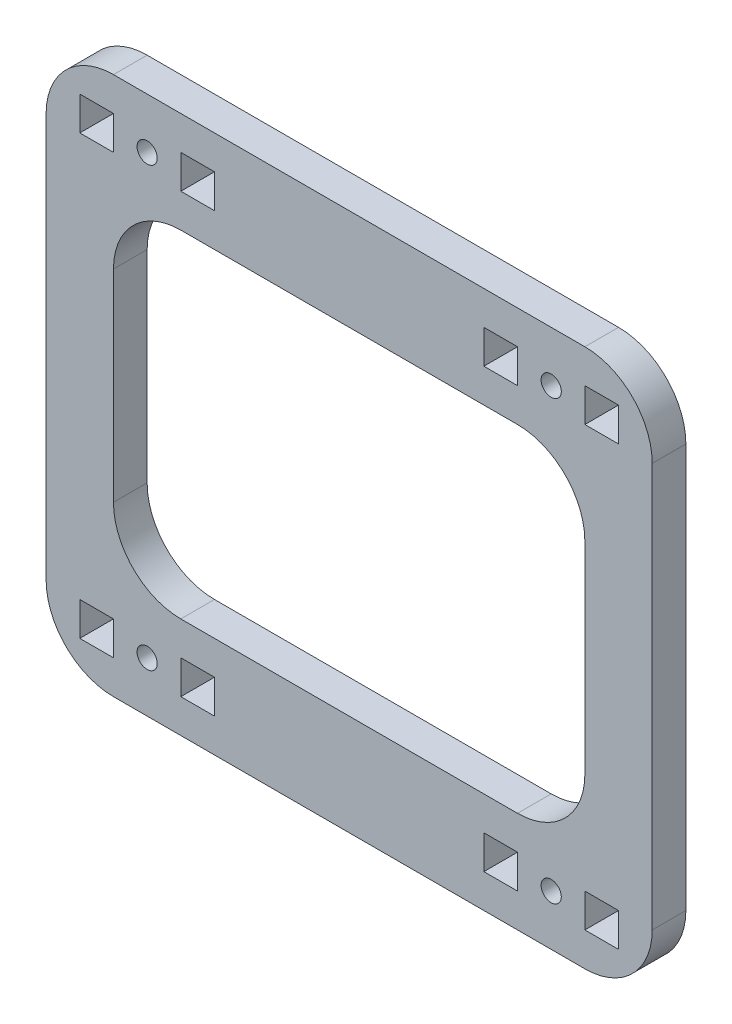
ISO-10303-21;
HEADER;
FILE_DESCRIPTION(('STEP AP214'),'2;1');
FILE_NAME('part.step','',(''),(''),'','','');
FILE_SCHEMA(('AUTOMOTIVE_DESIGN { 1 0 10303 214 1 1 1 1 }'));
ENDSEC;
DATA;
#1=APPLICATION_CONTEXT('core data for automotive mechanical design processes');
#2=APPLICATION_PROTOCOL_DEFINITION('international standard','automotive_design',2000,#1);
#3=PRODUCT_CONTEXT('',#1,'mechanical');
#4=PRODUCT('Part','Part','',(#3));
#5=PRODUCT_RELATED_PRODUCT_CATEGORY('part','',(#4));
#6=PRODUCT_DEFINITION_FORMATION('','',#4);
#7=PRODUCT_DEFINITION_CONTEXT('part definition',#1,'design');
#8=PRODUCT_DEFINITION('design','',#6,#7);
#9=PRODUCT_DEFINITION_SHAPE('','',#8);
#10=(LENGTH_UNIT() NAMED_UNIT(*) SI_UNIT(.MILLI.,.METRE.));
#11=(NAMED_UNIT(*) PLANE_ANGLE_UNIT() SI_UNIT($,.RADIAN.));
#12=(NAMED_UNIT(*) SI_UNIT($,.STERADIAN.) SOLID_ANGLE_UNIT());
#13=UNCERTAINTY_MEASURE_WITH_UNIT(LENGTH_MEASURE(1.E-05),#10,'distance_accuracy_value','');
#14=(GEOMETRIC_REPRESENTATION_CONTEXT(3) GLOBAL_UNCERTAINTY_ASSIGNED_CONTEXT((#13)) GLOBAL_UNIT_ASSIGNED_CONTEXT((#10,
#11,#12)) REPRESENTATION_CONTEXT('',''));
#15=CARTESIAN_POINT('',(0.,0.,0.));
#16=DIRECTION('',(0.,0.,1.));
#17=DIRECTION('',(1.,0.,0.));
#18=AXIS2_PLACEMENT_3D('',#15,#16,#17);
#19=CARTESIAN_POINT('',(0.,0.,5.));
#20=DIRECTION('',(0.,0.,-1.));
#21=DIRECTION('',(-1.,0.,0.));
#22=AXIS2_PLACEMENT_3D('',#19,#20,#21);
#23=PLANE('',#22);
#24=DIRECTION('',(0.,-1.,0.));
#25=VECTOR('',#24,1.);
#26=CARTESIAN_POINT('',(80.,5.00000000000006,5.00000000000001));
#27=LINE('',#26,#25);
#28=CARTESIAN_POINT('',(80.,10.0000000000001,5.00000000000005));
#29=VERTEX_POINT('',#28);
#30=CARTESIAN_POINT('',(80.,5.00000000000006,5.00000000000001));
#31=VERTEX_POINT('',#30);
#32=EDGE_CURVE('E391',#29,#31,#27,.T.);
#33=ORIENTED_EDGE('',*,*,#32,.F.);
#34=DIRECTION('',(-1.,0.,0.));
#35=VECTOR('',#34,1.);
#36=CARTESIAN_POINT('',(80.,10.0000000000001,5.00000000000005));
#37=LINE('',#36,#35);
#38=CARTESIAN_POINT('',(85.,10.0000000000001,5.));
#39=VERTEX_POINT('',#38);
#40=EDGE_CURVE('E399',#39,#29,#37,.T.);
#41=ORIENTED_EDGE('',*,*,#40,.F.);
#42=DIRECTION('',(0.,1.,0.));
#43=VECTOR('',#42,1.);
#44=CARTESIAN_POINT('',(85.,5.00000000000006,5.00000000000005));
#45=LINE('',#44,#43);
#46=CARTESIAN_POINT('',(85.,5.00000000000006,5.00000000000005));
#47=VERTEX_POINT('',#46);
#48=EDGE_CURVE('E396',#47,#39,#45,.T.);
#49=ORIENTED_EDGE('',*,*,#48,.F.);
#50=DIRECTION('',(1.,0.,0.));
#51=VECTOR('',#50,1.);
#52=CARTESIAN_POINT('',(80.,5.00000000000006,5.00000000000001));
#53=LINE('',#52,#51);
#54=EDGE_CURVE('E393',#31,#47,#53,.T.);
#55=ORIENTED_EDGE('',*,*,#54,.F.);
#56=EDGE_LOOP('',(#33,#41,#49,#55));
#57=FACE_BOUND('',#56,.T.);
#58=DIRECTION('',(0.,-1.,0.));
#59=VECTOR('',#58,1.);
#60=CARTESIAN_POINT('',(80.0000000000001,75.,5.00000000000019));
#61=LINE('',#60,#59);
#62=CARTESIAN_POINT('',(80.0000000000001,75.,5.00000000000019));
#63=VERTEX_POINT('',#62);
#64=CARTESIAN_POINT('',(80.0000000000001,70.,5.00000000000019));
#65=VERTEX_POINT('',#64);
#66=EDGE_CURVE('E459',#63,#65,#61,.T.);
#67=ORIENTED_EDGE('',*,*,#66,.F.);
#68=DIRECTION('',(-1.,0.,0.));
#69=VECTOR('',#68,1.);
#70=CARTESIAN_POINT('',(80.0000000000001,75.,5.00000000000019));
#71=LINE('',#70,#69);
#72=CARTESIAN_POINT('',(85.,75.,5.));
#73=VERTEX_POINT('',#72);
#74=EDGE_CURVE('E467',#73,#63,#71,.T.);
#75=ORIENTED_EDGE('',*,*,#74,.F.);
#76=DIRECTION('',(0.,1.,0.));
#77=VECTOR('',#76,1.);
#78=CARTESIAN_POINT('',(85.,75.,5.00000000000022));
#79=LINE('',#78,#77);
#80=CARTESIAN_POINT('',(85.,70.,5.00000000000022));
#81=VERTEX_POINT('',#80);
#82=EDGE_CURVE('E464',#81,#73,#79,.T.);
#83=ORIENTED_EDGE('',*,*,#82,.F.);
#84=DIRECTION('',(1.,0.,0.));
#85=VECTOR('',#84,1.);
#86=CARTESIAN_POINT('',(80.0000000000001,70.,5.00000000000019));
#87=LINE('',#86,#85);
#88=EDGE_CURVE('E461',#65,#81,#87,.T.);
#89=ORIENTED_EDGE('',*,*,#88,.F.);
#90=EDGE_LOOP('',(#67,#75,#83,#89));
#91=FACE_BOUND('',#90,.T.);
#92=DIRECTION('',(0.,1.,0.));
#93=VECTOR('',#92,1.);
#94=CARTESIAN_POINT('',(10.,4.99999999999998,5.00000000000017));
#95=LINE('',#94,#93);
#96=CARTESIAN_POINT('',(10.,4.99999999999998,5.00000000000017));
#97=VERTEX_POINT('',#96);
#98=CARTESIAN_POINT('',(10.,9.99999999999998,5.00000000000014));
#99=VERTEX_POINT('',#98);
#100=EDGE_CURVE('E527',#97,#99,#95,.T.);
#101=ORIENTED_EDGE('',*,*,#100,.F.);
#102=DIRECTION('',(1.,0.,0.));
#103=VECTOR('',#102,1.);
#104=CARTESIAN_POINT('',(10.,4.99999999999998,5.00000000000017));
#105=LINE('',#104,#103);
#106=CARTESIAN_POINT('',(5.00000000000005,4.99999999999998,5.));
#107=VERTEX_POINT('',#106);
#108=EDGE_CURVE('E535',#107,#97,#105,.T.);
#109=ORIENTED_EDGE('',*,*,#108,.F.);
#110=DIRECTION('',(0.,-1.,0.));
#111=VECTOR('',#110,1.);
#112=CARTESIAN_POINT('',(5.00000000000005,4.99999999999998,5.00000000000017));
#113=LINE('',#112,#111);
#114=CARTESIAN_POINT('',(5.00000000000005,9.99999999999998,5.00000000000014));
#115=VERTEX_POINT('',#114);
#116=EDGE_CURVE('E532',#115,#107,#113,.T.);
#117=ORIENTED_EDGE('',*,*,#116,.F.);
#118=DIRECTION('',(-1.,0.,0.));
#119=VECTOR('',#118,1.);
#120=CARTESIAN_POINT('',(10.,9.99999999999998,5.00000000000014));
#121=LINE('',#120,#119);
#122=EDGE_CURVE('E529',#99,#115,#121,.T.);
#123=ORIENTED_EDGE('',*,*,#122,.F.);
#124=EDGE_LOOP('',(#101,#109,#117,#123));
#125=FACE_BOUND('',#124,.T.);
#126=DIRECTION('',(0.,1.,0.));
#127=VECTOR('',#126,1.);
#128=CARTESIAN_POINT('',(10.,75.,5.));
#129=LINE('',#128,#127);
#130=CARTESIAN_POINT('',(10.,70.,5.));
#131=VERTEX_POINT('',#130);
#132=CARTESIAN_POINT('',(10.,75.,5.));
#133=VERTEX_POINT('',#132);
#134=EDGE_CURVE('E595',#131,#133,#129,.T.);
#135=ORIENTED_EDGE('',*,*,#134,.F.);
#136=DIRECTION('',(1.,0.,0.));
#137=VECTOR('',#136,1.);
#138=CARTESIAN_POINT('',(10.,70.,5.));
#139=LINE('',#138,#137);
#140=CARTESIAN_POINT('',(5.00000000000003,70.,5.));
#141=VERTEX_POINT('',#140);
#142=EDGE_CURVE('E603',#141,#131,#139,.T.);
#143=ORIENTED_EDGE('',*,*,#142,.F.);
#144=DIRECTION('',(0.,-1.,0.));
#145=VECTOR('',#144,1.);
#146=CARTESIAN_POINT('',(5.00000000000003,75.,5.));
#147=LINE('',#146,#145);
#148=CARTESIAN_POINT('',(5.00000000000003,75.,5.));
#149=VERTEX_POINT('',#148);
#150=EDGE_CURVE('E600',#149,#141,#147,.T.);
#151=ORIENTED_EDGE('',*,*,#150,.F.);
#152=DIRECTION('',(-1.,0.,0.));
#153=VECTOR('',#152,1.);
#154=CARTESIAN_POINT('',(10.,75.,5.));
#155=LINE('',#154,#153);
#156=EDGE_CURVE('E597',#133,#149,#155,.T.);
#157=ORIENTED_EDGE('',*,*,#156,.F.);
#158=EDGE_LOOP('',(#135,#143,#151,#157));
#159=FACE_BOUND('',#158,.T.);
#160=DIRECTION('',(0.,-1.,0.));
#161=VECTOR('',#160,1.);
#162=CARTESIAN_POINT('',(0.,0.,5.));
#163=LINE('',#162,#161);
#164=CARTESIAN_POINT('',(0.,70.,5.));
#165=VERTEX_POINT('',#164);
#166=CARTESIAN_POINT('',(0.,10.,5.));
#167=VERTEX_POINT('',#166);
#168=EDGE_CURVE('E659',#165,#167,#163,.T.);
#169=ORIENTED_EDGE('',*,*,#168,.T.);
#170=CARTESIAN_POINT('',(9.99999999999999,10.,5.));
#171=DIRECTION('',(0.,0.,-1.));
#172=DIRECTION('',(-1.,0.,0.));
#173=AXIS2_PLACEMENT_3D('',#170,#171,#172);
#174=CIRCLE('',#173,10.);
#175=CARTESIAN_POINT('',(9.99999999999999,0.,5.));
#176=VERTEX_POINT('',#175);
#177=EDGE_CURVE('E696',#167,#176,#174,.F.);
#178=ORIENTED_EDGE('',*,*,#177,.T.);
#179=DIRECTION('',(1.,0.,0.));
#180=VECTOR('',#179,1.);
#181=CARTESIAN_POINT('',(90.0000000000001,0.,5.));
#182=LINE('',#181,#180);
#183=CARTESIAN_POINT('',(80.0000000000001,0.,5.));
#184=VERTEX_POINT('',#183);
#185=EDGE_CURVE('E649',#176,#184,#182,.T.);
#186=ORIENTED_EDGE('',*,*,#185,.T.);
#187=CARTESIAN_POINT('',(80.0000000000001,10.,5.));
#188=DIRECTION('',(0.,0.,-1.));
#189=DIRECTION('',(-1.,0.,0.));
#190=AXIS2_PLACEMENT_3D('',#187,#188,#189);
#191=CIRCLE('',#190,10.);
#192=CARTESIAN_POINT('',(90.0000000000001,10.,5.));
#193=VERTEX_POINT('',#192);
#194=EDGE_CURVE('E694',#184,#193,#191,.F.);
#195=ORIENTED_EDGE('',*,*,#194,.T.);
#196=DIRECTION('',(0.,1.,0.));
#197=VECTOR('',#196,1.);
#198=CARTESIAN_POINT('',(90.0000000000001,80.,5.));
#199=LINE('',#198,#197);
#200=CARTESIAN_POINT('',(90.0000000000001,70.,5.));
#201=VERTEX_POINT('',#200);
#202=EDGE_CURVE('E652',#193,#201,#199,.T.);
#203=ORIENTED_EDGE('',*,*,#202,.T.);
#204=CARTESIAN_POINT('',(80.0000000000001,70.,5.));
#205=DIRECTION('',(0.,0.,-1.));
#206=DIRECTION('',(-1.,0.,0.));
#207=AXIS2_PLACEMENT_3D('',#204,#205,#206);
#208=CIRCLE('',#207,10.);
#209=CARTESIAN_POINT('',(80.0000000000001,80.,5.));
#210=VERTEX_POINT('',#209);
#211=EDGE_CURVE('E692',#201,#210,#208,.F.);
#212=ORIENTED_EDGE('',*,*,#211,.T.);
#213=DIRECTION('',(-1.,0.,0.));
#214=VECTOR('',#213,1.);
#215=CARTESIAN_POINT('',(0.,80.,5.));
#216=LINE('',#215,#214);
#217=CARTESIAN_POINT('',(10.,80.,5.));
#218=VERTEX_POINT('',#217);
#219=EDGE_CURVE('E656',#210,#218,#216,.T.);
#220=ORIENTED_EDGE('',*,*,#219,.T.);
#221=CARTESIAN_POINT('',(10.,70.,5.));
#222=DIRECTION('',(0.,0.,-1.));
#223=DIRECTION('',(-1.,0.,0.));
#224=AXIS2_PLACEMENT_3D('',#221,#222,#223);
#225=CIRCLE('',#224,10.);
#226=EDGE_CURVE('E690',#218,#165,#225,.F.);
#227=ORIENTED_EDGE('',*,*,#226,.T.);
#228=EDGE_LOOP('',(#169,#178,#186,#195,#203,#212,#220,#227));
#229=FACE_BOUND('',#228,.T.);
#230=DIRECTION('',(0.,-1.,0.));
#231=VECTOR('',#230,1.);
#232=CARTESIAN_POINT('',(10.,65.,5.));
#233=LINE('',#232,#231);
#234=CARTESIAN_POINT('',(10.,55.,5.));
#235=VERTEX_POINT('',#234);
#236=CARTESIAN_POINT('',(10.,25.,5.));
#237=VERTEX_POINT('',#236);
#238=EDGE_CURVE('E626',#235,#237,#233,.T.);
#239=ORIENTED_EDGE('',*,*,#238,.F.);
#240=CARTESIAN_POINT('',(20.,55.,5.));
#241=DIRECTION('',(0.,0.,-1.));
#242=DIRECTION('',(-1.,0.,0.));
#243=AXIS2_PLACEMENT_3D('',#240,#241,#242);
#244=CIRCLE('',#243,10.);
#245=CARTESIAN_POINT('',(20.,65.,5.));
#246=VERTEX_POINT('',#245);
#247=EDGE_CURVE('E11',#235,#246,#244,.T.);
#248=ORIENTED_EDGE('',*,*,#247,.T.);
#249=DIRECTION('',(-1.,0.,0.));
#250=VECTOR('',#249,1.);
#251=CARTESIAN_POINT('',(10.,65.,5.));
#252=LINE('',#251,#250);
#253=CARTESIAN_POINT('',(70.0000000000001,65.,5.));
#254=VERTEX_POINT('',#253);
#255=EDGE_CURVE('E635',#254,#246,#252,.T.);
#256=ORIENTED_EDGE('',*,*,#255,.F.);
#257=CARTESIAN_POINT('',(70.0000000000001,55.,5.));
#258=DIRECTION('',(0.,0.,-1.));
#259=DIRECTION('',(-1.,0.,0.));
#260=AXIS2_PLACEMENT_3D('',#257,#258,#259);
#261=CIRCLE('',#260,10.);
#262=CARTESIAN_POINT('',(80.0000000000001,55.,5.));
#263=VERTEX_POINT('',#262);
#264=EDGE_CURVE('E736',#254,#263,#261,.T.);
#265=ORIENTED_EDGE('',*,*,#264,.T.);
#266=DIRECTION('',(0.,1.,0.));
#267=VECTOR('',#266,1.);
#268=CARTESIAN_POINT('',(80.0000000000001,65.,5.));
#269=LINE('',#268,#267);
#270=CARTESIAN_POINT('',(80.,25.,5.));
#271=VERTEX_POINT('',#270);
#272=EDGE_CURVE('E632',#271,#263,#269,.T.);
#273=ORIENTED_EDGE('',*,*,#272,.F.);
#274=CARTESIAN_POINT('',(70.,25.,5.));
#275=DIRECTION('',(0.,0.,-1.));
#276=DIRECTION('',(-1.,0.,0.));
#277=AXIS2_PLACEMENT_3D('',#274,#275,#276);
#278=CIRCLE('',#277,10.);
#279=CARTESIAN_POINT('',(70.,15.,5.));
#280=VERTEX_POINT('',#279);
#281=EDGE_CURVE('E55',#271,#280,#278,.T.);
#282=ORIENTED_EDGE('',*,*,#281,.T.);
#283=DIRECTION('',(1.,0.,0.));
#284=VECTOR('',#283,1.);
#285=CARTESIAN_POINT('',(10.,15.,5.));
#286=LINE('',#285,#284);
#287=CARTESIAN_POINT('',(20.,15.,5.));
#288=VERTEX_POINT('',#287);
#289=EDGE_CURVE('E629',#288,#280,#286,.T.);
#290=ORIENTED_EDGE('',*,*,#289,.F.);
#291=CARTESIAN_POINT('',(20.,25.,5.));
#292=DIRECTION('',(0.,0.,-1.));
#293=DIRECTION('',(-1.,0.,0.));
#294=AXIS2_PLACEMENT_3D('',#291,#292,#293);
#295=CIRCLE('',#294,10.);
#296=EDGE_CURVE('E729',#288,#237,#295,.T.);
#297=ORIENTED_EDGE('',*,*,#296,.T.);
#298=EDGE_LOOP('',(#239,#248,#256,#265,#273,#282,#290,#297));
#299=FACE_BOUND('',#298,.T.);
#300=DIRECTION('',(0.,-1.,0.));
#301=VECTOR('',#300,1.);
#302=CARTESIAN_POINT('',(20.,75.,5.));
#303=LINE('',#302,#301);
#304=CARTESIAN_POINT('',(20.,75.,5.));
#305=VERTEX_POINT('',#304);
#306=CARTESIAN_POINT('',(20.,70.,5.));
#307=VERTEX_POINT('',#306);
#308=EDGE_CURVE('E564',#305,#307,#303,.T.);
#309=ORIENTED_EDGE('',*,*,#308,.F.);
#310=DIRECTION('',(-1.,0.,0.));
#311=VECTOR('',#310,1.);
#312=CARTESIAN_POINT('',(20.,75.,5.));
#313=LINE('',#312,#311);
#314=CARTESIAN_POINT('',(25.,75.,5.));
#315=VERTEX_POINT('',#314);
#316=EDGE_CURVE('E572',#315,#305,#313,.T.);
#317=ORIENTED_EDGE('',*,*,#316,.F.);
#318=DIRECTION('',(0.,1.,0.));
#319=VECTOR('',#318,1.);
#320=CARTESIAN_POINT('',(25.,75.,5.));
#321=LINE('',#320,#319);
#322=CARTESIAN_POINT('',(25.,70.,5.));
#323=VERTEX_POINT('',#322);
#324=EDGE_CURVE('E569',#323,#315,#321,.T.);
#325=ORIENTED_EDGE('',*,*,#324,.F.);
#326=DIRECTION('',(1.,0.,0.));
#327=VECTOR('',#326,1.);
#328=CARTESIAN_POINT('',(20.,70.,5.));
#329=LINE('',#328,#327);
#330=EDGE_CURVE('E566',#307,#323,#329,.T.);
#331=ORIENTED_EDGE('',*,*,#330,.F.);
#332=EDGE_LOOP('',(#309,#317,#325,#331));
#333=FACE_BOUND('',#332,.T.);
#334=CARTESIAN_POINT('',(15.,72.5,5.));
#335=DIRECTION('',(0.,0.,1.));
#336=DIRECTION('',(1.,0.,0.));
#337=AXIS2_PLACEMENT_3D('',#334,#335,#336);
#338=CIRCLE('',#337,1.5);
#339=CARTESIAN_POINT('',(16.5,72.5,5.));
#340=VERTEX_POINT('',#339);
#341=EDGE_CURVE('E558',#340,#340,#338,.T.);
#342=ORIENTED_EDGE('',*,*,#341,.F.);
#343=EDGE_LOOP('',(#342));
#344=FACE_BOUND('',#343,.T.);
#345=DIRECTION('',(0.,-1.,0.));
#346=VECTOR('',#345,1.);
#347=CARTESIAN_POINT('',(20.,4.99999999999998,5.00000000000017));
#348=LINE('',#347,#346);
#349=CARTESIAN_POINT('',(20.,9.99999999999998,5.00000000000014));
#350=VERTEX_POINT('',#349);
#351=CARTESIAN_POINT('',(20.,4.99999999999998,5.00000000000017));
#352=VERTEX_POINT('',#351);
#353=EDGE_CURVE('E496',#350,#352,#348,.T.);
#354=ORIENTED_EDGE('',*,*,#353,.F.);
#355=DIRECTION('',(-1.,0.,0.));
#356=VECTOR('',#355,1.);
#357=CARTESIAN_POINT('',(20.,9.99999999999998,5.00000000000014));
#358=LINE('',#357,#356);
#359=CARTESIAN_POINT('',(25.,9.99999999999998,5.));
#360=VERTEX_POINT('',#359);
#361=EDGE_CURVE('E504',#360,#350,#358,.T.);
#362=ORIENTED_EDGE('',*,*,#361,.F.);
#363=DIRECTION('',(0.,1.,0.));
#364=VECTOR('',#363,1.);
#365=CARTESIAN_POINT('',(25.,4.99999999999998,5.00000000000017));
#366=LINE('',#365,#364);
#367=CARTESIAN_POINT('',(25.,4.99999999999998,5.00000000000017));
#368=VERTEX_POINT('',#367);
#369=EDGE_CURVE('E501',#368,#360,#366,.T.);
#370=ORIENTED_EDGE('',*,*,#369,.F.);
#371=DIRECTION('',(1.,0.,0.));
#372=VECTOR('',#371,1.);
#373=CARTESIAN_POINT('',(20.,4.99999999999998,5.00000000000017));
#374=LINE('',#373,#372);
#375=EDGE_CURVE('E498',#352,#368,#374,.T.);
#376=ORIENTED_EDGE('',*,*,#375,.F.);
#377=EDGE_LOOP('',(#354,#362,#370,#376));
#378=FACE_BOUND('',#377,.T.);
#379=CARTESIAN_POINT('',(15.,7.49999999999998,5.00000000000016));
#380=DIRECTION('',(0.,0.,1.));
#381=DIRECTION('',(0.,1.,0.));
#382=AXIS2_PLACEMENT_3D('',#379,#380,#381);
#383=CIRCLE('',#382,1.5);
#384=CARTESIAN_POINT('',(15.,8.99999999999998,5.00000000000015));
#385=VERTEX_POINT('',#384);
#386=EDGE_CURVE('E490',#385,#385,#383,.T.);
#387=ORIENTED_EDGE('',*,*,#386,.F.);
#388=EDGE_LOOP('',(#387));
#389=FACE_BOUND('',#388,.T.);
#390=DIRECTION('',(0.,1.,0.));
#391=VECTOR('',#390,1.);
#392=CARTESIAN_POINT('',(70.,75.,5.00000000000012));
#393=LINE('',#392,#391);
#394=CARTESIAN_POINT('',(70.,70.,5.00000000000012));
#395=VERTEX_POINT('',#394);
#396=CARTESIAN_POINT('',(70.,75.,5.00000000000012));
#397=VERTEX_POINT('',#396);
#398=EDGE_CURVE('E428',#395,#397,#393,.T.);
#399=ORIENTED_EDGE('',*,*,#398,.F.);
#400=DIRECTION('',(1.,0.,0.));
#401=VECTOR('',#400,1.);
#402=CARTESIAN_POINT('',(70.,70.,5.00000000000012));
#403=LINE('',#402,#401);
#404=CARTESIAN_POINT('',(65.0000000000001,70.,5.));
#405=VERTEX_POINT('',#404);
#406=EDGE_CURVE('E436',#405,#395,#403,.T.);
#407=ORIENTED_EDGE('',*,*,#406,.F.);
#408=DIRECTION('',(0.,-1.,0.));
#409=VECTOR('',#408,1.);
#410=CARTESIAN_POINT('',(65.0000000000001,75.,5.00000000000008));
#411=LINE('',#410,#409);
#412=CARTESIAN_POINT('',(65.0000000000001,75.,5.00000000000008));
#413=VERTEX_POINT('',#412);
#414=EDGE_CURVE('E433',#413,#405,#411,.T.);
#415=ORIENTED_EDGE('',*,*,#414,.F.);
#416=DIRECTION('',(-1.,0.,0.));
#417=VECTOR('',#416,1.);
#418=CARTESIAN_POINT('',(70.,75.,5.00000000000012));
#419=LINE('',#418,#417);
#420=EDGE_CURVE('E430',#397,#413,#419,.T.);
#421=ORIENTED_EDGE('',*,*,#420,.F.);
#422=EDGE_LOOP('',(#399,#407,#415,#421));
#423=FACE_BOUND('',#422,.T.);
#424=CARTESIAN_POINT('',(75.0000000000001,72.5,5.00000000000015));
#425=DIRECTION('',(0.,0.,1.));
#426=DIRECTION('',(-1.,0.,0.));
#427=AXIS2_PLACEMENT_3D('',#424,#425,#426);
#428=CIRCLE('',#427,1.5);
#429=CARTESIAN_POINT('',(73.5000000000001,72.5,5.00000000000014));
#430=VERTEX_POINT('',#429);
#431=EDGE_CURVE('E422',#430,#430,#428,.T.);
#432=ORIENTED_EDGE('',*,*,#431,.F.);
#433=EDGE_LOOP('',(#432));
#434=FACE_BOUND('',#433,.T.);
#435=DIRECTION('',(0.,1.,0.));
#436=VECTOR('',#435,1.);
#437=CARTESIAN_POINT('',(70.,5.00000000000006,4.99999999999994));
#438=LINE('',#437,#436);
#439=CARTESIAN_POINT('',(70.,5.00000000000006,4.99999999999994));
#440=VERTEX_POINT('',#439);
#441=CARTESIAN_POINT('',(70.,10.0000000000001,4.99999999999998));
#442=VERTEX_POINT('',#441);
#443=EDGE_CURVE('E347',#440,#442,#438,.T.);
#444=ORIENTED_EDGE('',*,*,#443,.F.);
#445=DIRECTION('',(1.,0.,0.));
#446=VECTOR('',#445,1.);
#447=CARTESIAN_POINT('',(70.,5.00000000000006,4.99999999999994));
#448=LINE('',#447,#446);
#449=CARTESIAN_POINT('',(65.,5.00000000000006,5.));
#450=VERTEX_POINT('',#449);
#451=EDGE_CURVE('E373',#450,#440,#448,.T.);
#452=ORIENTED_EDGE('',*,*,#451,.F.);
#453=DIRECTION('',(0.,-1.,0.));
#454=VECTOR('',#453,1.);
#455=CARTESIAN_POINT('',(65.,5.00000000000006,4.99999999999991));
#456=LINE('',#455,#454);
#457=CARTESIAN_POINT('',(65.,10.0000000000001,4.99999999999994));
#458=VERTEX_POINT('',#457);
#459=EDGE_CURVE('E371',#458,#450,#456,.T.);
#460=ORIENTED_EDGE('',*,*,#459,.F.);
#461=DIRECTION('',(-1.,0.,0.));
#462=VECTOR('',#461,1.);
#463=CARTESIAN_POINT('',(70.,10.0000000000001,4.99999999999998));
#464=LINE('',#463,#462);
#465=EDGE_CURVE('E357',#442,#458,#464,.T.);
#466=ORIENTED_EDGE('',*,*,#465,.F.);
#467=EDGE_LOOP('',(#444,#452,#460,#466));
#468=FACE_BOUND('',#467,.T.);
#469=CARTESIAN_POINT('',(75.,7.50000000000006,5.));
#470=DIRECTION('',(0.,0.,1.));
#471=DIRECTION('',(1.,0.,0.));
#472=AXIS2_PLACEMENT_3D('',#469,#470,#471);
#473=CIRCLE('',#472,1.5);
#474=CARTESIAN_POINT('',(76.5,7.50000000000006,5.00000000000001));
#475=VERTEX_POINT('',#474);
#476=EDGE_CURVE('E380',#475,#475,#473,.T.);
#477=ORIENTED_EDGE('',*,*,#476,.F.);
#478=EDGE_LOOP('',(#477));
#479=FACE_BOUND('',#478,.T.);
#480=ADVANCED_FACE('F40',(#57,#91,#125,#159,#229,#299,#333,#344,#378,#389,#423,#434,#468,#479),
#23,.F.);
#481=CARTESIAN_POINT('',(0.,0.,0.));
#482=DIRECTION('',(0.,0.,-1.));
#483=DIRECTION('',(-1.,0.,0.));
#484=AXIS2_PLACEMENT_3D('',#481,#482,#483);
#485=PLANE('',#484);
#486=DIRECTION('',(1.,0.,0.));
#487=VECTOR('',#486,1.);
#488=CARTESIAN_POINT('',(70.,5.00000000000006,0.));
#489=LINE('',#488,#487);
#490=CARTESIAN_POINT('',(65.,5.00000000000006,0.));
#491=VERTEX_POINT('',#490);
#492=CARTESIAN_POINT('',(70.,5.00000000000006,0.));
#493=VERTEX_POINT('',#492);
#494=EDGE_CURVE('E358',#491,#493,#489,.T.);
#495=ORIENTED_EDGE('',*,*,#494,.T.);
#496=DIRECTION('',(0.,1.,0.));
#497=VECTOR('',#496,1.);
#498=CARTESIAN_POINT('',(70.,5.00000000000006,0.));
#499=LINE('',#498,#497);
#500=CARTESIAN_POINT('',(70.,10.0000000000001,0.));
#501=VERTEX_POINT('',#500);
#502=EDGE_CURVE('E378',#493,#501,#499,.T.);
#503=ORIENTED_EDGE('',*,*,#502,.T.);
#504=DIRECTION('',(-1.,0.,0.));
#505=VECTOR('',#504,1.);
#506=CARTESIAN_POINT('',(70.,10.0000000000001,0.));
#507=LINE('',#506,#505);
#508=CARTESIAN_POINT('',(65.,10.0000000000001,0.));
#509=VERTEX_POINT('',#508);
#510=EDGE_CURVE('E364',#501,#509,#507,.T.);
#511=ORIENTED_EDGE('',*,*,#510,.T.);
#512=DIRECTION('',(0.,-1.,0.));
#513=VECTOR('',#512,1.);
#514=CARTESIAN_POINT('',(65.,5.00000000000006,0.));
#515=LINE('',#514,#513);
#516=EDGE_CURVE('E382',#509,#491,#515,.T.);
#517=ORIENTED_EDGE('',*,*,#516,.T.);
#518=EDGE_LOOP('',(#495,#503,#511,#517));
#519=FACE_BOUND('',#518,.T.);
#520=DIRECTION('',(-1.,0.,0.));
#521=VECTOR('',#520,1.);
#522=CARTESIAN_POINT('',(80.,10.0000000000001,0.));
#523=LINE('',#522,#521);
#524=CARTESIAN_POINT('',(85.,10.0000000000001,0.));
#525=VERTEX_POINT('',#524);
#526=CARTESIAN_POINT('',(80.,10.0000000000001,0.));
#527=VERTEX_POINT('',#526);
#528=EDGE_CURVE('E394',#525,#527,#523,.T.);
#529=ORIENTED_EDGE('',*,*,#528,.T.);
#530=DIRECTION('',(0.,-1.,0.));
#531=VECTOR('',#530,1.);
#532=CARTESIAN_POINT('',(80.,5.00000000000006,0.));
#533=LINE('',#532,#531);
#534=CARTESIAN_POINT('',(80.,5.00000000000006,0.));
#535=VERTEX_POINT('',#534);
#536=EDGE_CURVE('E365',#527,#535,#533,.T.);
#537=ORIENTED_EDGE('',*,*,#536,.T.);
#538=DIRECTION('',(1.,0.,0.));
#539=VECTOR('',#538,1.);
#540=CARTESIAN_POINT('',(80.,5.00000000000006,0.));
#541=LINE('',#540,#539);
#542=CARTESIAN_POINT('',(85.,5.00000000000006,0.));
#543=VERTEX_POINT('',#542);
#544=EDGE_CURVE('E404',#535,#543,#541,.T.);
#545=ORIENTED_EDGE('',*,*,#544,.T.);
#546=DIRECTION('',(0.,1.,0.));
#547=VECTOR('',#546,1.);
#548=CARTESIAN_POINT('',(85.,5.00000000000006,0.));
#549=LINE('',#548,#547);
#550=EDGE_CURVE('E407',#543,#525,#549,.T.);
#551=ORIENTED_EDGE('',*,*,#550,.T.);
#552=EDGE_LOOP('',(#529,#537,#545,#551));
#553=FACE_BOUND('',#552,.T.);
#554=CARTESIAN_POINT('',(75.0000000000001,72.5,1.51014585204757E-13));
#555=DIRECTION('',(0.,0.,1.));
#556=DIRECTION('',(-1.,0.,0.));
#557=AXIS2_PLACEMENT_3D('',#554,#555,#556);
#558=CIRCLE('',#557,1.5);
#559=CARTESIAN_POINT('',(73.5000000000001,72.5,1.40540141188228E-13));
#560=VERTEX_POINT('',#559);
#561=EDGE_CURVE('E421',#560,#560,#558,.T.);
#562=ORIENTED_EDGE('',*,*,#561,.T.);
#563=EDGE_LOOP('',(#562));
#564=FACE_BOUND('',#563,.T.);
#565=DIRECTION('',(-1.,0.,0.));
#566=VECTOR('',#565,1.);
#567=CARTESIAN_POINT('',(20.,9.99999999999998,1.38292222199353E-13));
#568=LINE('',#567,#566);
#569=CARTESIAN_POINT('',(25.,9.99999999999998,1.38292222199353E-13));
#570=VERTEX_POINT('',#569);
#571=CARTESIAN_POINT('',(20.,9.99999999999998,0.));
#572=VERTEX_POINT('',#571);
#573=EDGE_CURVE('E499',#570,#572,#568,.T.);
#574=ORIENTED_EDGE('',*,*,#573,.T.);
#575=DIRECTION('',(0.,-1.,0.));
#576=VECTOR('',#575,1.);
#577=CARTESIAN_POINT('',(20.,4.99999999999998,1.73207035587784E-13));
#578=LINE('',#577,#576);
#579=CARTESIAN_POINT('',(20.,4.99999999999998,1.73207035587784E-13));
#580=VERTEX_POINT('',#579);
#581=EDGE_CURVE('E493',#572,#580,#578,.T.);
#582=ORIENTED_EDGE('',*,*,#581,.T.);
#583=DIRECTION('',(1.,0.,0.));
#584=VECTOR('',#583,1.);
#585=CARTESIAN_POINT('',(20.,4.99999999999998,1.73207035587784E-13));
#586=LINE('',#585,#584);
#587=CARTESIAN_POINT('',(25.,4.99999999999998,1.73207035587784E-13));
#588=VERTEX_POINT('',#587);
#589=EDGE_CURVE('E509',#580,#588,#586,.T.);
#590=ORIENTED_EDGE('',*,*,#589,.T.);
#591=DIRECTION('',(0.,1.,0.));
#592=VECTOR('',#591,1.);
#593=CARTESIAN_POINT('',(25.,4.99999999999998,1.73207035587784E-13));
#594=LINE('',#593,#592);
#595=EDGE_CURVE('E512',#588,#570,#594,.T.);
#596=ORIENTED_EDGE('',*,*,#595,.T.);
#597=EDGE_LOOP('',(#574,#582,#590,#596));
#598=FACE_BOUND('',#597,.T.);
#599=DIRECTION('',(1.,0.,0.));
#600=VECTOR('',#599,1.);
#601=CARTESIAN_POINT('',(10.,4.99999999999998,1.73207035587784E-13));
#602=LINE('',#601,#600);
#603=CARTESIAN_POINT('',(5.00000000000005,4.99999999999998,1.73207035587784E-13));
#604=VERTEX_POINT('',#603);
#605=CARTESIAN_POINT('',(10.,4.99999999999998,0.));
#606=VERTEX_POINT('',#605);
#607=EDGE_CURVE('E530',#604,#606,#602,.T.);
#608=ORIENTED_EDGE('',*,*,#607,.T.);
#609=DIRECTION('',(0.,1.,0.));
#610=VECTOR('',#609,1.);
#611=CARTESIAN_POINT('',(10.,4.99999999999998,1.73207035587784E-13));
#612=LINE('',#611,#610);
#613=CARTESIAN_POINT('',(10.,9.99999999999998,1.38292222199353E-13));
#614=VERTEX_POINT('',#613);
#615=EDGE_CURVE('E526',#606,#614,#612,.T.);
#616=ORIENTED_EDGE('',*,*,#615,.T.);
#617=DIRECTION('',(-1.,0.,0.));
#618=VECTOR('',#617,1.);
#619=CARTESIAN_POINT('',(10.,9.99999999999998,1.38292222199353E-13));
#620=LINE('',#619,#618);
#621=CARTESIAN_POINT('',(5.00000000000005,9.99999999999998,1.38292222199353E-13));
#622=VERTEX_POINT('',#621);
#623=EDGE_CURVE('E540',#614,#622,#620,.T.);
#624=ORIENTED_EDGE('',*,*,#623,.T.);
#625=DIRECTION('',(0.,-1.,0.));
#626=VECTOR('',#625,1.);
#627=CARTESIAN_POINT('',(5.00000000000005,4.99999999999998,1.73207035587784E-13));
#628=LINE('',#627,#626);
#629=EDGE_CURVE('E543',#622,#604,#628,.T.);
#630=ORIENTED_EDGE('',*,*,#629,.T.);
#631=EDGE_LOOP('',(#608,#616,#624,#630));
#632=FACE_BOUND('',#631,.T.);
#633=CARTESIAN_POINT('',(15.,72.5,0.));
#634=DIRECTION('',(0.,0.,1.));
#635=DIRECTION('',(1.,0.,0.));
#636=AXIS2_PLACEMENT_3D('',#633,#634,#635);
#637=CIRCLE('',#636,1.5);
#638=CARTESIAN_POINT('',(16.5,72.5,0.));
#639=VERTEX_POINT('',#638);
#640=EDGE_CURVE('E557',#639,#639,#637,.T.);
#641=ORIENTED_EDGE('',*,*,#640,.T.);
#642=EDGE_LOOP('',(#641));
#643=FACE_BOUND('',#642,.T.);
#644=DIRECTION('',(1.,0.,0.));
#645=VECTOR('',#644,1.);
#646=CARTESIAN_POINT('',(90.0000000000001,0.,0.));
#647=LINE('',#646,#645);
#648=CARTESIAN_POINT('',(9.99999999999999,0.,0.));
#649=VERTEX_POINT('',#648);
#650=CARTESIAN_POINT('',(80.0000000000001,0.,0.));
#651=VERTEX_POINT('',#650);
#652=EDGE_CURVE('E638',#649,#651,#647,.T.);
#653=ORIENTED_EDGE('',*,*,#652,.F.);
#654=CARTESIAN_POINT('',(9.99999999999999,10.,0.));
#655=DIRECTION('',(0.,0.,-1.));
#656=DIRECTION('',(-1.,0.,0.));
#657=AXIS2_PLACEMENT_3D('',#654,#655,#656);
#658=CIRCLE('',#657,10.);
#659=CARTESIAN_POINT('',(0.,10.,0.));
#660=VERTEX_POINT('',#659);
#661=EDGE_CURVE('E683',#649,#660,#658,.T.);
#662=ORIENTED_EDGE('',*,*,#661,.T.);
#663=DIRECTION('',(0.,-1.,0.));
#664=VECTOR('',#663,1.);
#665=CARTESIAN_POINT('',(0.,0.,0.));
#666=LINE('',#665,#664);
#667=CARTESIAN_POINT('',(0.,70.,0.));
#668=VERTEX_POINT('',#667);
#669=EDGE_CURVE('E653',#668,#660,#666,.T.);
#670=ORIENTED_EDGE('',*,*,#669,.F.);
#671=CARTESIAN_POINT('',(10.,70.,0.));
#672=DIRECTION('',(0.,0.,-1.));
#673=DIRECTION('',(-1.,0.,0.));
#674=AXIS2_PLACEMENT_3D('',#671,#672,#673);
#675=CIRCLE('',#674,10.);
#676=CARTESIAN_POINT('',(10.,80.,0.));
#677=VERTEX_POINT('',#676);
#678=EDGE_CURVE('E677',#668,#677,#675,.T.);
#679=ORIENTED_EDGE('',*,*,#678,.T.);
#680=DIRECTION('',(-1.,0.,0.));
#681=VECTOR('',#680,1.);
#682=CARTESIAN_POINT('',(0.,80.,0.));
#683=LINE('',#682,#681);
#684=CARTESIAN_POINT('',(80.0000000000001,80.,0.));
#685=VERTEX_POINT('',#684);
#686=EDGE_CURVE('E668',#685,#677,#683,.T.);
#687=ORIENTED_EDGE('',*,*,#686,.F.);
#688=CARTESIAN_POINT('',(80.0000000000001,70.,0.));
#689=DIRECTION('',(0.,0.,-1.));
#690=DIRECTION('',(-1.,0.,0.));
#691=AXIS2_PLACEMENT_3D('',#688,#689,#690);
#692=CIRCLE('',#691,10.);
#693=CARTESIAN_POINT('',(90.0000000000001,70.,0.));
#694=VERTEX_POINT('',#693);
#695=EDGE_CURVE('E679',#685,#694,#692,.T.);
#696=ORIENTED_EDGE('',*,*,#695,.T.);
#697=DIRECTION('',(0.,1.,0.));
#698=VECTOR('',#697,1.);
#699=CARTESIAN_POINT('',(90.0000000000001,80.,0.));
#700=LINE('',#699,#698);
#701=CARTESIAN_POINT('',(90.0000000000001,10.,0.));
#702=VERTEX_POINT('',#701);
#703=EDGE_CURVE('E665',#702,#694,#700,.T.);
#704=ORIENTED_EDGE('',*,*,#703,.F.);
#705=CARTESIAN_POINT('',(80.0000000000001,10.,0.));
#706=DIRECTION('',(0.,0.,-1.));
#707=DIRECTION('',(-1.,0.,0.));
#708=AXIS2_PLACEMENT_3D('',#705,#706,#707);
#709=CIRCLE('',#708,10.);
#710=EDGE_CURVE('E681',#702,#651,#709,.T.);
#711=ORIENTED_EDGE('',*,*,#710,.T.);
#712=EDGE_LOOP('',(#653,#662,#670,#679,#687,#696,#704,#711));
#713=FACE_BOUND('',#712,.T.);
#714=DIRECTION('',(0.,1.,0.));
#715=VECTOR('',#714,1.);
#716=CARTESIAN_POINT('',(80.0000000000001,65.,0.));
#717=LINE('',#716,#715);
#718=CARTESIAN_POINT('',(80.,25.,0.));
#719=VERTEX_POINT('',#718);
#720=CARTESIAN_POINT('',(80.0000000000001,55.,0.));
#721=VERTEX_POINT('',#720);
#722=EDGE_CURVE('E644',#719,#721,#717,.T.);
#723=ORIENTED_EDGE('',*,*,#722,.T.);
#724=CARTESIAN_POINT('',(70.0000000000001,55.,0.));
#725=DIRECTION('',(0.,0.,-1.));
#726=DIRECTION('',(-1.,0.,0.));
#727=AXIS2_PLACEMENT_3D('',#724,#725,#726);
#728=CIRCLE('',#727,10.);
#729=CARTESIAN_POINT('',(70.0000000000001,65.,0.));
#730=VERTEX_POINT('',#729);
#731=EDGE_CURVE('E734',#721,#730,#728,.F.);
#732=ORIENTED_EDGE('',*,*,#731,.T.);
#733=DIRECTION('',(-1.,0.,0.));
#734=VECTOR('',#733,1.);
#735=CARTESIAN_POINT('',(10.,65.,0.));
#736=LINE('',#735,#734);
#737=CARTESIAN_POINT('',(20.,65.,0.));
#738=VERTEX_POINT('',#737);
#739=EDGE_CURVE('E630',#730,#738,#736,.T.);
#740=ORIENTED_EDGE('',*,*,#739,.T.);
#741=CARTESIAN_POINT('',(20.,55.,0.));
#742=DIRECTION('',(0.,0.,-1.));
#743=DIRECTION('',(-1.,0.,0.));
#744=AXIS2_PLACEMENT_3D('',#741,#742,#743);
#745=CIRCLE('',#744,10.);
#746=CARTESIAN_POINT('',(10.,55.,0.));
#747=VERTEX_POINT('',#746);
#748=EDGE_CURVE('E48',#738,#747,#745,.F.);
#749=ORIENTED_EDGE('',*,*,#748,.T.);
#750=DIRECTION('',(0.,-1.,0.));
#751=VECTOR('',#750,1.);
#752=CARTESIAN_POINT('',(10.,65.,0.));
#753=LINE('',#752,#751);
#754=CARTESIAN_POINT('',(10.,25.,0.));
#755=VERTEX_POINT('',#754);
#756=EDGE_CURVE('E625',#747,#755,#753,.T.);
#757=ORIENTED_EDGE('',*,*,#756,.T.);
#758=CARTESIAN_POINT('',(20.,25.,0.));
#759=DIRECTION('',(0.,0.,-1.));
#760=DIRECTION('',(-1.,0.,0.));
#761=AXIS2_PLACEMENT_3D('',#758,#759,#760);
#762=CIRCLE('',#761,10.);
#763=CARTESIAN_POINT('',(20.,15.,0.));
#764=VERTEX_POINT('',#763);
#765=EDGE_CURVE('E727',#755,#764,#762,.F.);
#766=ORIENTED_EDGE('',*,*,#765,.T.);
#767=DIRECTION('',(1.,0.,0.));
#768=VECTOR('',#767,1.);
#769=CARTESIAN_POINT('',(10.,15.,0.));
#770=LINE('',#769,#768);
#771=CARTESIAN_POINT('',(70.,15.,0.));
#772=VERTEX_POINT('',#771);
#773=EDGE_CURVE('E641',#764,#772,#770,.T.);
#774=ORIENTED_EDGE('',*,*,#773,.T.);
#775=CARTESIAN_POINT('',(70.,25.,0.));
#776=DIRECTION('',(0.,0.,-1.));
#777=DIRECTION('',(-1.,0.,0.));
#778=AXIS2_PLACEMENT_3D('',#775,#776,#777);
#779=CIRCLE('',#778,10.);
#780=EDGE_CURVE('E731',#772,#719,#779,.F.);
#781=ORIENTED_EDGE('',*,*,#780,.T.);
#782=EDGE_LOOP('',(#723,#732,#740,#749,#757,#766,#774,#781));
#783=FACE_BOUND('',#782,.T.);
#784=DIRECTION('',(1.,0.,0.));
#785=VECTOR('',#784,1.);
#786=CARTESIAN_POINT('',(10.,70.,0.));
#787=LINE('',#786,#785);
#788=CARTESIAN_POINT('',(5.00000000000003,70.,0.));
#789=VERTEX_POINT('',#788);
#790=CARTESIAN_POINT('',(10.,70.,0.));
#791=VERTEX_POINT('',#790);
#792=EDGE_CURVE('E598',#789,#791,#787,.T.);
#793=ORIENTED_EDGE('',*,*,#792,.T.);
#794=DIRECTION('',(0.,1.,0.));
#795=VECTOR('',#794,1.);
#796=CARTESIAN_POINT('',(10.,75.,0.));
#797=LINE('',#796,#795);
#798=CARTESIAN_POINT('',(10.,75.,0.));
#799=VERTEX_POINT('',#798);
#800=EDGE_CURVE('E594',#791,#799,#797,.T.);
#801=ORIENTED_EDGE('',*,*,#800,.T.);
#802=DIRECTION('',(-1.,0.,0.));
#803=VECTOR('',#802,1.);
#804=CARTESIAN_POINT('',(10.,75.,0.));
#805=LINE('',#804,#803);
#806=CARTESIAN_POINT('',(5.00000000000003,75.,0.));
#807=VERTEX_POINT('',#806);
#808=EDGE_CURVE('E608',#799,#807,#805,.T.);
#809=ORIENTED_EDGE('',*,*,#808,.T.);
#810=DIRECTION('',(0.,-1.,0.));
#811=VECTOR('',#810,1.);
#812=CARTESIAN_POINT('',(5.00000000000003,75.,0.));
#813=LINE('',#812,#811);
#814=EDGE_CURVE('E611',#807,#789,#813,.T.);
#815=ORIENTED_EDGE('',*,*,#814,.T.);
#816=EDGE_LOOP('',(#793,#801,#809,#815));
#817=FACE_BOUND('',#816,.T.);
#818=DIRECTION('',(-1.,0.,0.));
#819=VECTOR('',#818,1.);
#820=CARTESIAN_POINT('',(20.,75.,0.));
#821=LINE('',#820,#819);
#822=CARTESIAN_POINT('',(25.,75.,0.));
#823=VERTEX_POINT('',#822);
#824=CARTESIAN_POINT('',(20.,75.,0.));
#825=VERTEX_POINT('',#824);
#826=EDGE_CURVE('E567',#823,#825,#821,.T.);
#827=ORIENTED_EDGE('',*,*,#826,.T.);
#828=DIRECTION('',(0.,-1.,0.));
#829=VECTOR('',#828,1.);
#830=CARTESIAN_POINT('',(20.,75.,0.));
#831=LINE('',#830,#829);
#832=CARTESIAN_POINT('',(20.,70.,0.));
#833=VERTEX_POINT('',#832);
#834=EDGE_CURVE('E561',#825,#833,#831,.T.);
#835=ORIENTED_EDGE('',*,*,#834,.T.);
#836=DIRECTION('',(1.,0.,0.));
#837=VECTOR('',#836,1.);
#838=CARTESIAN_POINT('',(20.,70.,0.));
#839=LINE('',#838,#837);
#840=CARTESIAN_POINT('',(25.,70.,0.));
#841=VERTEX_POINT('',#840);
#842=EDGE_CURVE('E577',#833,#841,#839,.T.);
#843=ORIENTED_EDGE('',*,*,#842,.T.);
#844=DIRECTION('',(0.,1.,0.));
#845=VECTOR('',#844,1.);
#846=CARTESIAN_POINT('',(25.,75.,0.));
#847=LINE('',#846,#845);
#848=EDGE_CURVE('E580',#841,#823,#847,.T.);
#849=ORIENTED_EDGE('',*,*,#848,.T.);
#850=EDGE_LOOP('',(#827,#835,#843,#849));
#851=FACE_BOUND('',#850,.T.);
#852=CARTESIAN_POINT('',(15.,7.49999999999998,1.55749628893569E-13));
#853=DIRECTION('',(0.,0.,1.));
#854=DIRECTION('',(0.,1.,0.));
#855=AXIS2_PLACEMENT_3D('',#852,#853,#854);
#856=CIRCLE('',#855,1.5);
#857=CARTESIAN_POINT('',(15.,8.99999999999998,1.45275184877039E-13));
#858=VERTEX_POINT('',#857);
#859=EDGE_CURVE('E489',#858,#858,#856,.T.);
#860=ORIENTED_EDGE('',*,*,#859,.T.);
#861=EDGE_LOOP('',(#860));
#862=FACE_BOUND('',#861,.T.);
#863=DIRECTION('',(-1.,0.,0.));
#864=VECTOR('',#863,1.);
#865=CARTESIAN_POINT('',(80.0000000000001,75.,1.85929398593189E-13));
#866=LINE('',#865,#864);
#867=CARTESIAN_POINT('',(85.,75.,2.2084421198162E-13));
#868=VERTEX_POINT('',#867);
#869=CARTESIAN_POINT('',(80.0000000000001,75.,0.));
#870=VERTEX_POINT('',#869);
#871=EDGE_CURVE('E462',#868,#870,#866,.T.);
#872=ORIENTED_EDGE('',*,*,#871,.T.);
#873=DIRECTION('',(0.,-1.,0.));
#874=VECTOR('',#873,1.);
#875=CARTESIAN_POINT('',(80.0000000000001,75.,1.85929398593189E-13));
#876=LINE('',#875,#874);
#877=CARTESIAN_POINT('',(80.0000000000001,70.,1.85929398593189E-13));
#878=VERTEX_POINT('',#877);
#879=EDGE_CURVE('E458',#870,#878,#876,.T.);
#880=ORIENTED_EDGE('',*,*,#879,.T.);
#881=DIRECTION('',(1.,0.,0.));
#882=VECTOR('',#881,1.);
#883=CARTESIAN_POINT('',(80.0000000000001,70.,1.85929398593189E-13));
#884=LINE('',#883,#882);
#885=CARTESIAN_POINT('',(85.,70.,2.2084421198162E-13));
#886=VERTEX_POINT('',#885);
#887=EDGE_CURVE('E472',#878,#886,#884,.T.);
#888=ORIENTED_EDGE('',*,*,#887,.T.);
#889=DIRECTION('',(0.,1.,0.));
#890=VECTOR('',#889,1.);
#891=CARTESIAN_POINT('',(85.,75.,2.2084421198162E-13));
#892=LINE('',#891,#890);
#893=EDGE_CURVE('E475',#886,#868,#892,.T.);
#894=ORIENTED_EDGE('',*,*,#893,.T.);
#895=EDGE_LOOP('',(#872,#880,#888,#894));
#896=FACE_BOUND('',#895,.T.);
#897=DIRECTION('',(1.,0.,0.));
#898=VECTOR('',#897,1.);
#899=CARTESIAN_POINT('',(70.,70.,1.16099771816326E-13));
#900=LINE('',#899,#898);
#901=CARTESIAN_POINT('',(65.0000000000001,70.,0.));
#902=VERTEX_POINT('',#901);
#903=CARTESIAN_POINT('',(70.,70.,0.));
#904=VERTEX_POINT('',#903);
#905=EDGE_CURVE('E431',#902,#904,#900,.T.);
#906=ORIENTED_EDGE('',*,*,#905,.T.);
#907=DIRECTION('',(0.,1.,0.));
#908=VECTOR('',#907,1.);
#909=CARTESIAN_POINT('',(70.,75.,1.16099771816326E-13));
#910=LINE('',#909,#908);
#911=CARTESIAN_POINT('',(70.,75.,1.16099771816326E-13));
#912=VERTEX_POINT('',#911);
#913=EDGE_CURVE('E425',#904,#912,#910,.T.);
#914=ORIENTED_EDGE('',*,*,#913,.T.);
#915=DIRECTION('',(-1.,0.,0.));
#916=VECTOR('',#915,1.);
#917=CARTESIAN_POINT('',(70.,75.,1.16099771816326E-13));
#918=LINE('',#917,#916);
#919=CARTESIAN_POINT('',(65.0000000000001,75.,0.));
#920=VERTEX_POINT('',#919);
#921=EDGE_CURVE('E441',#912,#920,#918,.T.);
#922=ORIENTED_EDGE('',*,*,#921,.T.);
#923=DIRECTION('',(0.,-1.,0.));
#924=VECTOR('',#923,1.);
#925=CARTESIAN_POINT('',(65.0000000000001,75.,0.));
#926=LINE('',#925,#924);
#927=EDGE_CURVE('E444',#920,#902,#926,.T.);
#928=ORIENTED_EDGE('',*,*,#927,.T.);
#929=EDGE_LOOP('',(#906,#914,#922,#928));
#930=FACE_BOUND('',#929,.T.);
#931=CARTESIAN_POINT('',(75.,7.50000000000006,0.));
#932=DIRECTION('',(0.,0.,1.));
#933=DIRECTION('',(1.,0.,0.));
#934=AXIS2_PLACEMENT_3D('',#931,#932,#933);
#935=CIRCLE('',#934,1.5);
#936=CARTESIAN_POINT('',(76.5,7.50000000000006,0.));
#937=VERTEX_POINT('',#936);
#938=EDGE_CURVE('E1331',#937,#937,#935,.T.);
#939=ORIENTED_EDGE('',*,*,#938,.T.);
#940=EDGE_LOOP('',(#939));
#941=FACE_BOUND('',#940,.T.);
#942=ADVANCED_FACE('F739',(#519,#553,#564,#598,#632,#643,#713,#783,#817,#851,#862,#896,#930,
#941),#485,.T.);
#943=CARTESIAN_POINT('',(90.0000000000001,0.,5.));
#944=DIRECTION('',(0.,1.,0.));
#945=DIRECTION('',(-1.,0.,0.));
#946=AXIS2_PLACEMENT_3D('',#943,#944,#945);
#947=PLANE('',#946);
#948=ORIENTED_EDGE('',*,*,#185,.F.);
#949=DIRECTION('',(0.,0.,-1.));
#950=VECTOR('',#949,1.);
#951=CARTESIAN_POINT('',(9.99999999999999,0.,5.));
#952=LINE('',#951,#950);
#953=EDGE_CURVE('E674',#176,#649,#952,.T.);
#954=ORIENTED_EDGE('',*,*,#953,.T.);
#955=ORIENTED_EDGE('',*,*,#652,.T.);
#956=DIRECTION('',(0.,0.,-1.));
#957=VECTOR('',#956,1.);
#958=CARTESIAN_POINT('',(80.0000000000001,0.,5.));
#959=LINE('',#958,#957);
#960=EDGE_CURVE('E662',#651,#184,#959,.F.);
#961=ORIENTED_EDGE('',*,*,#960,.T.);
#962=EDGE_LOOP('',(#948,#954,#955,#961));
#963=FACE_BOUND('',#962,.T.);
#964=ADVANCED_FACE('F790',(#963),#947,.F.);
#965=CARTESIAN_POINT('',(90.0000000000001,80.,5.));
#966=DIRECTION('',(-1.,0.,0.));
#967=DIRECTION('',(0.,-1.,0.));
#968=AXIS2_PLACEMENT_3D('',#965,#966,#967);
#969=PLANE('',#968);
#970=ORIENTED_EDGE('',*,*,#202,.F.);
#971=DIRECTION('',(0.,0.,-1.));
#972=VECTOR('',#971,1.);
#973=CARTESIAN_POINT('',(90.0000000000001,10.,5.));
#974=LINE('',#973,#972);
#975=EDGE_CURVE('E709',#193,#702,#974,.T.);
#976=ORIENTED_EDGE('',*,*,#975,.T.);
#977=ORIENTED_EDGE('',*,*,#703,.T.);
#978=DIRECTION('',(0.,0.,-1.));
#979=VECTOR('',#978,1.);
#980=CARTESIAN_POINT('',(90.0000000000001,70.,5.));
#981=LINE('',#980,#979);
#982=EDGE_CURVE('E707',#694,#201,#981,.F.);
#983=ORIENTED_EDGE('',*,*,#982,.T.);
#984=EDGE_LOOP('',(#970,#976,#977,#983));
#985=FACE_BOUND('',#984,.T.);
#986=ADVANCED_FACE('F805',(#985),#969,.F.);
#987=CARTESIAN_POINT('',(0.,80.,5.));
#988=DIRECTION('',(0.,-1.,0.));
#989=DIRECTION('',(0.,0.,-1.));
#990=AXIS2_PLACEMENT_3D('',#987,#988,#989);
#991=PLANE('',#990);
#992=ORIENTED_EDGE('',*,*,#219,.F.);
#993=DIRECTION('',(0.,0.,-1.));
#994=VECTOR('',#993,1.);
#995=CARTESIAN_POINT('',(80.0000000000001,80.,5.));
#996=LINE('',#995,#994);
#997=EDGE_CURVE('E724',#210,#685,#996,.T.);
#998=ORIENTED_EDGE('',*,*,#997,.T.);
#999=ORIENTED_EDGE('',*,*,#686,.T.);
#1000=DIRECTION('',(0.,0.,-1.));
#1001=VECTOR('',#1000,1.);
#1002=CARTESIAN_POINT('',(10.,80.,5.));
#1003=LINE('',#1002,#1001);
#1004=EDGE_CURVE('E722',#677,#218,#1003,.F.);
#1005=ORIENTED_EDGE('',*,*,#1004,.T.);
#1006=EDGE_LOOP('',(#992,#998,#999,#1005));
#1007=FACE_BOUND('',#1006,.T.);
#1008=ADVANCED_FACE('F801',(#1007),#991,.F.);
#1009=CARTESIAN_POINT('',(0.,0.,5.));
#1010=DIRECTION('',(1.,0.,0.));
#1011=DIRECTION('',(0.,1.,0.));
#1012=AXIS2_PLACEMENT_3D('',#1009,#1010,#1011);
#1013=PLANE('',#1012);
#1014=ORIENTED_EDGE('',*,*,#669,.T.);
#1015=DIRECTION('',(0.,0.,-1.));
#1016=VECTOR('',#1015,1.);
#1017=CARTESIAN_POINT('',(0.,10.,5.));
#1018=LINE('',#1017,#1016);
#1019=EDGE_CURVE('E688',#660,#167,#1018,.F.);
#1020=ORIENTED_EDGE('',*,*,#1019,.T.);
#1021=ORIENTED_EDGE('',*,*,#168,.F.);
#1022=DIRECTION('',(0.,0.,-1.));
#1023=VECTOR('',#1022,1.);
#1024=CARTESIAN_POINT('',(0.,70.,5.));
#1025=LINE('',#1024,#1023);
#1026=EDGE_CURVE('E685',#165,#668,#1025,.T.);
#1027=ORIENTED_EDGE('',*,*,#1026,.T.);
#1028=EDGE_LOOP('',(#1014,#1020,#1021,#1027));
#1029=FACE_BOUND('',#1028,.T.);
#1030=ADVANCED_FACE('F798',(#1029),#1013,.F.);
#1031=CARTESIAN_POINT('',(10.,65.,5.));
#1032=DIRECTION('',(1.,0.,0.));
#1033=DIRECTION('',(0.,1.,0.));
#1034=AXIS2_PLACEMENT_3D('',#1031,#1032,#1033);
#1035=PLANE('',#1034);
#1036=ORIENTED_EDGE('',*,*,#238,.T.);
#1037=DIRECTION('',(0.,0.,-1.));
#1038=VECTOR('',#1037,1.);
#1039=CARTESIAN_POINT('',(10.,25.,0.));
#1040=LINE('',#1039,#1038);
#1041=EDGE_CURVE('E700',#237,#755,#1040,.T.);
#1042=ORIENTED_EDGE('',*,*,#1041,.T.);
#1043=ORIENTED_EDGE('',*,*,#756,.F.);
#1044=DIRECTION('',(0.,0.,-1.));
#1045=VECTOR('',#1044,1.);
#1046=CARTESIAN_POINT('',(10.,55.,5.));
#1047=LINE('',#1046,#1045);
#1048=EDGE_CURVE('E698',#747,#235,#1047,.F.);
#1049=ORIENTED_EDGE('',*,*,#1048,.T.);
#1050=EDGE_LOOP('',(#1036,#1042,#1043,#1049));
#1051=FACE_BOUND('',#1050,.T.);
#1052=ADVANCED_FACE('F746',(#1051),#1035,.T.);
#1053=CARTESIAN_POINT('',(10.,15.,5.));
#1054=DIRECTION('',(0.,1.,0.));
#1055=DIRECTION('',(-1.,0.,0.));
#1056=AXIS2_PLACEMENT_3D('',#1053,#1054,#1055);
#1057=PLANE('',#1056);
#1058=ORIENTED_EDGE('',*,*,#773,.F.);
#1059=DIRECTION('',(0.,0.,-1.));
#1060=VECTOR('',#1059,1.);
#1061=CARTESIAN_POINT('',(20.,15.,5.));
#1062=LINE('',#1061,#1060);
#1063=EDGE_CURVE('E62',#764,#288,#1062,.F.);
#1064=ORIENTED_EDGE('',*,*,#1063,.T.);
#1065=ORIENTED_EDGE('',*,*,#289,.T.);
#1066=DIRECTION('',(0.,0.,-1.));
#1067=VECTOR('',#1066,1.);
#1068=CARTESIAN_POINT('',(70.,15.,0.));
#1069=LINE('',#1068,#1067);
#1070=EDGE_CURVE('E703',#280,#772,#1069,.T.);
#1071=ORIENTED_EDGE('',*,*,#1070,.T.);
#1072=EDGE_LOOP('',(#1058,#1064,#1065,#1071));
#1073=FACE_BOUND('',#1072,.T.);
#1074=ADVANCED_FACE('F767',(#1073),#1057,.T.);
#1075=CARTESIAN_POINT('',(80.0000000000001,65.,5.));
#1076=DIRECTION('',(-1.,0.,0.));
#1077=DIRECTION('',(0.,-1.,0.));
#1078=AXIS2_PLACEMENT_3D('',#1075,#1076,#1077);
#1079=PLANE('',#1078);
#1080=ORIENTED_EDGE('',*,*,#722,.F.);
#1081=DIRECTION('',(0.,0.,-1.));
#1082=VECTOR('',#1081,1.);
#1083=CARTESIAN_POINT('',(80.,25.,5.));
#1084=LINE('',#1083,#1082);
#1085=EDGE_CURVE('E715',#719,#271,#1084,.F.);
#1086=ORIENTED_EDGE('',*,*,#1085,.T.);
#1087=ORIENTED_EDGE('',*,*,#272,.T.);
#1088=DIRECTION('',(0.,0.,-1.));
#1089=VECTOR('',#1088,1.);
#1090=CARTESIAN_POINT('',(80.0000000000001,55.,0.));
#1091=LINE('',#1090,#1089);
#1092=EDGE_CURVE('E712',#263,#721,#1091,.T.);
#1093=ORIENTED_EDGE('',*,*,#1092,.T.);
#1094=EDGE_LOOP('',(#1080,#1086,#1087,#1093));
#1095=FACE_BOUND('',#1094,.T.);
#1096=ADVANCED_FACE('F762',(#1095),#1079,.T.);
#1097=CARTESIAN_POINT('',(10.,65.,5.));
#1098=DIRECTION('',(0.,-1.,0.));
#1099=DIRECTION('',(0.,0.,-1.));
#1100=AXIS2_PLACEMENT_3D('',#1097,#1098,#1099);
#1101=PLANE('',#1100);
#1102=ORIENTED_EDGE('',*,*,#739,.F.);
#1103=DIRECTION('',(0.,0.,-1.));
#1104=VECTOR('',#1103,1.);
#1105=CARTESIAN_POINT('',(70.0000000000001,65.,5.));
#1106=LINE('',#1105,#1104);
#1107=EDGE_CURVE('E720',#730,#254,#1106,.F.);
#1108=ORIENTED_EDGE('',*,*,#1107,.T.);
#1109=ORIENTED_EDGE('',*,*,#255,.T.);
#1110=DIRECTION('',(0.,0.,-1.));
#1111=VECTOR('',#1110,1.);
#1112=CARTESIAN_POINT('',(20.,65.,0.));
#1113=LINE('',#1112,#1111);
#1114=EDGE_CURVE('E717',#246,#738,#1113,.T.);
#1115=ORIENTED_EDGE('',*,*,#1114,.T.);
#1116=EDGE_LOOP('',(#1102,#1108,#1109,#1115));
#1117=FACE_BOUND('',#1116,.T.);
#1118=ADVANCED_FACE('F755',(#1117),#1101,.T.);
#1119=CARTESIAN_POINT('',(10.,75.,5.));
#1120=DIRECTION('',(-1.,0.,0.));
#1121=DIRECTION('',(0.,0.,1.));
#1122=AXIS2_PLACEMENT_3D('',#1119,#1120,#1121);
#1123=PLANE('',#1122);
#1124=ORIENTED_EDGE('',*,*,#800,.F.);
#1125=DIRECTION('',(0.,0.,-1.));
#1126=VECTOR('',#1125,1.);
#1127=CARTESIAN_POINT('',(10.,70.,5.));
#1128=LINE('',#1127,#1126);
#1129=EDGE_CURVE('E605',#131,#791,#1128,.T.);
#1130=ORIENTED_EDGE('',*,*,#1129,.F.);
#1131=ORIENTED_EDGE('',*,*,#134,.T.);
#1132=DIRECTION('',(0.,0.,-1.));
#1133=VECTOR('',#1132,1.);
#1134=CARTESIAN_POINT('',(10.,75.,5.));
#1135=LINE('',#1134,#1133);
#1136=EDGE_CURVE('E622',#133,#799,#1135,.T.);
#1137=ORIENTED_EDGE('',*,*,#1136,.T.);
#1138=EDGE_LOOP('',(#1124,#1130,#1131,#1137));
#1139=FACE_BOUND('',#1138,.T.);
#1140=ADVANCED_FACE('F1201',(#1139),#1123,.T.);
#1141=CARTESIAN_POINT('',(10.,75.,5.));
#1142=DIRECTION('',(0.,-1.,0.));
#1143=DIRECTION('',(0.,0.,-1.));
#1144=AXIS2_PLACEMENT_3D('',#1141,#1142,#1143);
#1145=PLANE('',#1144);
#1146=ORIENTED_EDGE('',*,*,#808,.F.);
#1147=ORIENTED_EDGE('',*,*,#1136,.F.);
#1148=ORIENTED_EDGE('',*,*,#156,.T.);
#1149=DIRECTION('',(0.,0.,-1.));
#1150=VECTOR('',#1149,1.);
#1151=CARTESIAN_POINT('',(5.00000000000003,75.,5.));
#1152=LINE('',#1151,#1150);
#1153=EDGE_CURVE('E620',#149,#807,#1152,.T.);
#1154=ORIENTED_EDGE('',*,*,#1153,.T.);
#1155=EDGE_LOOP('',(#1146,#1147,#1148,#1154));
#1156=FACE_BOUND('',#1155,.T.);
#1157=ADVANCED_FACE('F1192',(#1156),#1145,.T.);
#1158=CARTESIAN_POINT('',(5.00000000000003,75.,5.));
#1159=DIRECTION('',(1.,0.,0.));
#1160=DIRECTION('',(0.,0.,-1.));
#1161=AXIS2_PLACEMENT_3D('',#1158,#1159,#1160);
#1162=PLANE('',#1161);
#1163=ORIENTED_EDGE('',*,*,#814,.F.);
#1164=ORIENTED_EDGE('',*,*,#1153,.F.);
#1165=ORIENTED_EDGE('',*,*,#150,.T.);
#1166=DIRECTION('',(0.,0.,-1.));
#1167=VECTOR('',#1166,1.);
#1168=CARTESIAN_POINT('',(5.00000000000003,70.,5.));
#1169=LINE('',#1168,#1167);
#1170=EDGE_CURVE('E618',#141,#789,#1169,.T.);
#1171=ORIENTED_EDGE('',*,*,#1170,.T.);
#1172=EDGE_LOOP('',(#1163,#1164,#1165,#1171));
#1173=FACE_BOUND('',#1172,.T.);
#1174=ADVANCED_FACE('F1183',(#1173),#1162,.T.);
#1175=CARTESIAN_POINT('',(10.,70.,5.));
#1176=DIRECTION('',(0.,1.,0.));
#1177=DIRECTION('',(0.,0.,1.));
#1178=AXIS2_PLACEMENT_3D('',#1175,#1176,#1177);
#1179=PLANE('',#1178);
#1180=ORIENTED_EDGE('',*,*,#792,.F.);
#1181=ORIENTED_EDGE('',*,*,#1170,.F.);
#1182=ORIENTED_EDGE('',*,*,#142,.T.);
#1183=ORIENTED_EDGE('',*,*,#1129,.T.);
#1184=EDGE_LOOP('',(#1180,#1181,#1182,#1183));
#1185=FACE_BOUND('',#1184,.T.);
#1186=ADVANCED_FACE('F1174',(#1185),#1179,.T.);
#1187=CARTESIAN_POINT('',(20.,75.,5.));
#1188=DIRECTION('',(1.,0.,0.));
#1189=DIRECTION('',(0.,0.,-1.));
#1190=AXIS2_PLACEMENT_3D('',#1187,#1188,#1189);
#1191=PLANE('',#1190);
#1192=ORIENTED_EDGE('',*,*,#834,.F.);
#1193=DIRECTION('',(0.,0.,-1.));
#1194=VECTOR('',#1193,1.);
#1195=CARTESIAN_POINT('',(20.,75.,5.));
#1196=LINE('',#1195,#1194);
#1197=EDGE_CURVE('E574',#305,#825,#1196,.T.);
#1198=ORIENTED_EDGE('',*,*,#1197,.F.);
#1199=ORIENTED_EDGE('',*,*,#308,.T.);
#1200=DIRECTION('',(0.,0.,-1.));
#1201=VECTOR('',#1200,1.);
#1202=CARTESIAN_POINT('',(20.,70.,5.));
#1203=LINE('',#1202,#1201);
#1204=EDGE_CURVE('E591',#307,#833,#1203,.T.);
#1205=ORIENTED_EDGE('',*,*,#1204,.T.);
#1206=EDGE_LOOP('',(#1192,#1198,#1199,#1205));
#1207=FACE_BOUND('',#1206,.T.);
#1208=ADVANCED_FACE('F1165',(#1207),#1191,.T.);
#1209=CARTESIAN_POINT('',(20.,70.,5.));
#1210=DIRECTION('',(0.,1.,0.));
#1211=DIRECTION('',(0.,0.,1.));
#1212=AXIS2_PLACEMENT_3D('',#1209,#1210,#1211);
#1213=PLANE('',#1212);
#1214=ORIENTED_EDGE('',*,*,#842,.F.);
#1215=ORIENTED_EDGE('',*,*,#1204,.F.);
#1216=ORIENTED_EDGE('',*,*,#330,.T.);
#1217=DIRECTION('',(0.,0.,-1.));
#1218=VECTOR('',#1217,1.);
#1219=CARTESIAN_POINT('',(25.,70.,5.));
#1220=LINE('',#1219,#1218);
#1221=EDGE_CURVE('E589',#323,#841,#1220,.T.);
#1222=ORIENTED_EDGE('',*,*,#1221,.T.);
#1223=EDGE_LOOP('',(#1214,#1215,#1216,#1222));
#1224=FACE_BOUND('',#1223,.T.);
#1225=ADVANCED_FACE('F1156',(#1224),#1213,.T.);
#1226=CARTESIAN_POINT('',(25.,75.,5.));
#1227=DIRECTION('',(-1.,0.,0.));
#1228=DIRECTION('',(0.,0.,1.));
#1229=AXIS2_PLACEMENT_3D('',#1226,#1227,#1228);
#1230=PLANE('',#1229);
#1231=ORIENTED_EDGE('',*,*,#848,.F.);
#1232=ORIENTED_EDGE('',*,*,#1221,.F.);
#1233=ORIENTED_EDGE('',*,*,#324,.T.);
#1234=DIRECTION('',(0.,0.,-1.));
#1235=VECTOR('',#1234,1.);
#1236=CARTESIAN_POINT('',(25.,75.,5.));
#1237=LINE('',#1236,#1235);
#1238=EDGE_CURVE('E587',#315,#823,#1237,.T.);
#1239=ORIENTED_EDGE('',*,*,#1238,.T.);
#1240=EDGE_LOOP('',(#1231,#1232,#1233,#1239));
#1241=FACE_BOUND('',#1240,.T.);
#1242=ADVANCED_FACE('F1147',(#1241),#1230,.T.);
#1243=CARTESIAN_POINT('',(20.,75.,5.));
#1244=DIRECTION('',(0.,-1.,0.));
#1245=DIRECTION('',(0.,0.,-1.));
#1246=AXIS2_PLACEMENT_3D('',#1243,#1244,#1245);
#1247=PLANE('',#1246);
#1248=ORIENTED_EDGE('',*,*,#826,.F.);
#1249=ORIENTED_EDGE('',*,*,#1238,.F.);
#1250=ORIENTED_EDGE('',*,*,#316,.T.);
#1251=ORIENTED_EDGE('',*,*,#1197,.T.);
#1252=EDGE_LOOP('',(#1248,#1249,#1250,#1251));
#1253=FACE_BOUND('',#1252,.T.);
#1254=ADVANCED_FACE('F1138',(#1253),#1247,.T.);
#1255=CARTESIAN_POINT('',(15.,72.5,5.));
#1256=DIRECTION('',(0.,0.,-1.));
#1257=DIRECTION('',(-1.,0.,0.));
#1258=AXIS2_PLACEMENT_3D('',#1255,#1256,#1257);
#1259=CYLINDRICAL_SURFACE('',#1258,1.5);
#1260=ORIENTED_EDGE('',*,*,#341,.T.);
#1261=EDGE_LOOP('',(#1260));
#1262=FACE_BOUND('',#1261,.T.);
#1263=ORIENTED_EDGE('',*,*,#640,.F.);
#1264=EDGE_LOOP('',(#1263));
#1265=FACE_BOUND('',#1264,.T.);
#1266=ADVANCED_FACE('F1129',(#1262,#1265),#1259,.F.);
#1267=CARTESIAN_POINT('',(10.,4.99999999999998,5.00000000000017));
#1268=DIRECTION('',(-1.,0.,0.));
#1269=DIRECTION('',(0.,0.,1.));
#1270=AXIS2_PLACEMENT_3D('',#1267,#1268,#1269);
#1271=PLANE('',#1270);
#1272=ORIENTED_EDGE('',*,*,#615,.F.);
#1273=DIRECTION('',(0.,0.,-1.));
#1274=VECTOR('',#1273,1.);
#1275=CARTESIAN_POINT('',(10.,4.99999999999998,5.00000000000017));
#1276=LINE('',#1275,#1274);
#1277=EDGE_CURVE('E537',#97,#606,#1276,.T.);
#1278=ORIENTED_EDGE('',*,*,#1277,.F.);
#1279=ORIENTED_EDGE('',*,*,#100,.T.);
#1280=DIRECTION('',(0.,0.,-1.));
#1281=VECTOR('',#1280,1.);
#1282=CARTESIAN_POINT('',(10.,9.99999999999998,5.00000000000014));
#1283=LINE('',#1282,#1281);
#1284=EDGE_CURVE('E554',#99,#614,#1283,.T.);
#1285=ORIENTED_EDGE('',*,*,#1284,.T.);
#1286=EDGE_LOOP('',(#1272,#1278,#1279,#1285));
#1287=FACE_BOUND('',#1286,.T.);
#1288=ADVANCED_FACE('F1120',(#1287),#1271,.T.);
#1289=CARTESIAN_POINT('',(10.,9.99999999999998,5.00000000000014));
#1290=DIRECTION('',(0.,-1.,0.));
#1291=DIRECTION('',(1.,0.,0.));
#1292=AXIS2_PLACEMENT_3D('',#1289,#1290,#1291);
#1293=PLANE('',#1292);
#1294=ORIENTED_EDGE('',*,*,#623,.F.);
#1295=ORIENTED_EDGE('',*,*,#1284,.F.);
#1296=ORIENTED_EDGE('',*,*,#122,.T.);
#1297=DIRECTION('',(0.,0.,-1.));
#1298=VECTOR('',#1297,1.);
#1299=CARTESIAN_POINT('',(5.00000000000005,9.99999999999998,5.00000000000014));
#1300=LINE('',#1299,#1298);
#1301=EDGE_CURVE('E552',#115,#622,#1300,.T.);
#1302=ORIENTED_EDGE('',*,*,#1301,.T.);
#1303=EDGE_LOOP('',(#1294,#1295,#1296,#1302));
#1304=FACE_BOUND('',#1303,.T.);
#1305=ADVANCED_FACE('F1111',(#1304),#1293,.T.);
#1306=CARTESIAN_POINT('',(5.00000000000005,4.99999999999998,5.00000000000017));
#1307=DIRECTION('',(1.,0.,0.));
#1308=DIRECTION('',(0.,0.,-1.));
#1309=AXIS2_PLACEMENT_3D('',#1306,#1307,#1308);
#1310=PLANE('',#1309);
#1311=ORIENTED_EDGE('',*,*,#629,.F.);
#1312=ORIENTED_EDGE('',*,*,#1301,.F.);
#1313=ORIENTED_EDGE('',*,*,#116,.T.);
#1314=DIRECTION('',(0.,0.,-1.));
#1315=VECTOR('',#1314,1.);
#1316=CARTESIAN_POINT('',(5.00000000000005,4.99999999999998,5.00000000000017));
#1317=LINE('',#1316,#1315);
#1318=EDGE_CURVE('E550',#107,#604,#1317,.T.);
#1319=ORIENTED_EDGE('',*,*,#1318,.T.);
#1320=EDGE_LOOP('',(#1311,#1312,#1313,#1319));
#1321=FACE_BOUND('',#1320,.T.);
#1322=ADVANCED_FACE('F1102',(#1321),#1310,.T.);
#1323=CARTESIAN_POINT('',(10.,4.99999999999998,5.00000000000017));
#1324=DIRECTION('',(0.,1.,0.));
#1325=DIRECTION('',(-1.,0.,0.));
#1326=AXIS2_PLACEMENT_3D('',#1323,#1324,#1325);
#1327=PLANE('',#1326);
#1328=ORIENTED_EDGE('',*,*,#607,.F.);
#1329=ORIENTED_EDGE('',*,*,#1318,.F.);
#1330=ORIENTED_EDGE('',*,*,#108,.T.);
#1331=ORIENTED_EDGE('',*,*,#1277,.T.);
#1332=EDGE_LOOP('',(#1328,#1329,#1330,#1331));
#1333=FACE_BOUND('',#1332,.T.);
#1334=ADVANCED_FACE('F1093',(#1333),#1327,.T.);
#1335=CARTESIAN_POINT('',(20.,4.99999999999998,5.00000000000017));
#1336=DIRECTION('',(1.,0.,0.));
#1337=DIRECTION('',(0.,0.,-1.));
#1338=AXIS2_PLACEMENT_3D('',#1335,#1336,#1337);
#1339=PLANE('',#1338);
#1340=ORIENTED_EDGE('',*,*,#581,.F.);
#1341=DIRECTION('',(0.,0.,-1.));
#1342=VECTOR('',#1341,1.);
#1343=CARTESIAN_POINT('',(20.,9.99999999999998,5.00000000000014));
#1344=LINE('',#1343,#1342);
#1345=EDGE_CURVE('E506',#350,#572,#1344,.T.);
#1346=ORIENTED_EDGE('',*,*,#1345,.F.);
#1347=ORIENTED_EDGE('',*,*,#353,.T.);
#1348=DIRECTION('',(0.,0.,-1.));
#1349=VECTOR('',#1348,1.);
#1350=CARTESIAN_POINT('',(20.,4.99999999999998,5.00000000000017));
#1351=LINE('',#1350,#1349);
#1352=EDGE_CURVE('E523',#352,#580,#1351,.T.);
#1353=ORIENTED_EDGE('',*,*,#1352,.T.);
#1354=EDGE_LOOP('',(#1340,#1346,#1347,#1353));
#1355=FACE_BOUND('',#1354,.T.);
#1356=ADVANCED_FACE('F1084',(#1355),#1339,.T.);
#1357=CARTESIAN_POINT('',(20.,4.99999999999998,5.00000000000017));
#1358=DIRECTION('',(0.,1.,0.));
#1359=DIRECTION('',(0.,0.,1.));
#1360=AXIS2_PLACEMENT_3D('',#1357,#1358,#1359);
#1361=PLANE('',#1360);
#1362=ORIENTED_EDGE('',*,*,#589,.F.);
#1363=ORIENTED_EDGE('',*,*,#1352,.F.);
#1364=ORIENTED_EDGE('',*,*,#375,.T.);
#1365=DIRECTION('',(0.,0.,-1.));
#1366=VECTOR('',#1365,1.);
#1367=CARTESIAN_POINT('',(25.,4.99999999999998,5.00000000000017));
#1368=LINE('',#1367,#1366);
#1369=EDGE_CURVE('E521',#368,#588,#1368,.T.);
#1370=ORIENTED_EDGE('',*,*,#1369,.T.);
#1371=EDGE_LOOP('',(#1362,#1363,#1364,#1370));
#1372=FACE_BOUND('',#1371,.T.);
#1373=ADVANCED_FACE('F1075',(#1372),#1361,.T.);
#1374=CARTESIAN_POINT('',(25.,4.99999999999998,5.00000000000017));
#1375=DIRECTION('',(-1.,0.,0.));
#1376=DIRECTION('',(0.,0.,1.));
#1377=AXIS2_PLACEMENT_3D('',#1374,#1375,#1376);
#1378=PLANE('',#1377);
#1379=ORIENTED_EDGE('',*,*,#595,.F.);
#1380=ORIENTED_EDGE('',*,*,#1369,.F.);
#1381=ORIENTED_EDGE('',*,*,#369,.T.);
#1382=DIRECTION('',(0.,0.,-1.));
#1383=VECTOR('',#1382,1.);
#1384=CARTESIAN_POINT('',(25.,9.99999999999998,5.00000000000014));
#1385=LINE('',#1384,#1383);
#1386=EDGE_CURVE('E519',#360,#570,#1385,.T.);
#1387=ORIENTED_EDGE('',*,*,#1386,.T.);
#1388=EDGE_LOOP('',(#1379,#1380,#1381,#1387));
#1389=FACE_BOUND('',#1388,.T.);
#1390=ADVANCED_FACE('F1066',(#1389),#1378,.T.);
#1391=CARTESIAN_POINT('',(20.,9.99999999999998,5.00000000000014));
#1392=DIRECTION('',(0.,-1.,0.));
#1393=DIRECTION('',(0.,0.,-1.));
#1394=AXIS2_PLACEMENT_3D('',#1391,#1392,#1393);
#1395=PLANE('',#1394);
#1396=ORIENTED_EDGE('',*,*,#573,.F.);
#1397=ORIENTED_EDGE('',*,*,#1386,.F.);
#1398=ORIENTED_EDGE('',*,*,#361,.T.);
#1399=ORIENTED_EDGE('',*,*,#1345,.T.);
#1400=EDGE_LOOP('',(#1396,#1397,#1398,#1399));
#1401=FACE_BOUND('',#1400,.T.);
#1402=ADVANCED_FACE('F1057',(#1401),#1395,.T.);
#1403=CARTESIAN_POINT('',(15.,7.49999999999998,5.00000000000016));
#1404=DIRECTION('',(0.,0.,-1.));
#1405=DIRECTION('',(-1.,0.,0.));
#1406=AXIS2_PLACEMENT_3D('',#1403,#1404,#1405);
#1407=CYLINDRICAL_SURFACE('',#1406,1.5);
#1408=ORIENTED_EDGE('',*,*,#386,.T.);
#1409=EDGE_LOOP('',(#1408));
#1410=FACE_BOUND('',#1409,.T.);
#1411=ORIENTED_EDGE('',*,*,#859,.F.);
#1412=EDGE_LOOP('',(#1411));
#1413=FACE_BOUND('',#1412,.T.);
#1414=ADVANCED_FACE('F1048',(#1410,#1413),#1407,.F.);
#1415=CARTESIAN_POINT('',(80.0000000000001,75.,5.00000000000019));
#1416=DIRECTION('',(1.,0.,0.));
#1417=DIRECTION('',(0.,0.,-1.));
#1418=AXIS2_PLACEMENT_3D('',#1415,#1416,#1417);
#1419=PLANE('',#1418);
#1420=ORIENTED_EDGE('',*,*,#879,.F.);
#1421=DIRECTION('',(0.,0.,-1.));
#1422=VECTOR('',#1421,1.);
#1423=CARTESIAN_POINT('',(80.0000000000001,75.,5.00000000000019));
#1424=LINE('',#1423,#1422);
#1425=EDGE_CURVE('E469',#63,#870,#1424,.T.);
#1426=ORIENTED_EDGE('',*,*,#1425,.F.);
#1427=ORIENTED_EDGE('',*,*,#66,.T.);
#1428=DIRECTION('',(0.,0.,-1.));
#1429=VECTOR('',#1428,1.);
#1430=CARTESIAN_POINT('',(80.0000000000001,70.,5.00000000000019));
#1431=LINE('',#1430,#1429);
#1432=EDGE_CURVE('E486',#65,#878,#1431,.T.);
#1433=ORIENTED_EDGE('',*,*,#1432,.T.);
#1434=EDGE_LOOP('',(#1420,#1426,#1427,#1433));
#1435=FACE_BOUND('',#1434,.T.);
#1436=ADVANCED_FACE('F1039',(#1435),#1419,.T.);
#1437=CARTESIAN_POINT('',(80.0000000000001,70.,5.00000000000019));
#1438=DIRECTION('',(0.,1.,0.));
#1439=DIRECTION('',(0.,0.,1.));
#1440=AXIS2_PLACEMENT_3D('',#1437,#1438,#1439);
#1441=PLANE('',#1440);
#1442=ORIENTED_EDGE('',*,*,#887,.F.);
#1443=ORIENTED_EDGE('',*,*,#1432,.F.);
#1444=ORIENTED_EDGE('',*,*,#88,.T.);
#1445=DIRECTION('',(0.,0.,-1.));
#1446=VECTOR('',#1445,1.);
#1447=CARTESIAN_POINT('',(85.,70.,5.00000000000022));
#1448=LINE('',#1447,#1446);
#1449=EDGE_CURVE('E484',#81,#886,#1448,.T.);
#1450=ORIENTED_EDGE('',*,*,#1449,.T.);
#1451=EDGE_LOOP('',(#1442,#1443,#1444,#1450));
#1452=FACE_BOUND('',#1451,.T.);
#1453=ADVANCED_FACE('F1030',(#1452),#1441,.T.);
#1454=CARTESIAN_POINT('',(85.,75.,5.00000000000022));
#1455=DIRECTION('',(-1.,0.,0.));
#1456=DIRECTION('',(0.,0.,1.));
#1457=AXIS2_PLACEMENT_3D('',#1454,#1455,#1456);
#1458=PLANE('',#1457);
#1459=ORIENTED_EDGE('',*,*,#893,.F.);
#1460=ORIENTED_EDGE('',*,*,#1449,.F.);
#1461=ORIENTED_EDGE('',*,*,#82,.T.);
#1462=DIRECTION('',(0.,0.,-1.));
#1463=VECTOR('',#1462,1.);
#1464=CARTESIAN_POINT('',(85.,75.,5.00000000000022));
#1465=LINE('',#1464,#1463);
#1466=EDGE_CURVE('E482',#73,#868,#1465,.T.);
#1467=ORIENTED_EDGE('',*,*,#1466,.T.);
#1468=EDGE_LOOP('',(#1459,#1460,#1461,#1467));
#1469=FACE_BOUND('',#1468,.T.);
#1470=ADVANCED_FACE('F1021',(#1469),#1458,.T.);
#1471=CARTESIAN_POINT('',(80.0000000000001,75.,5.00000000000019));
#1472=DIRECTION('',(0.,-1.,0.));
#1473=DIRECTION('',(0.,0.,-1.));
#1474=AXIS2_PLACEMENT_3D('',#1471,#1472,#1473);
#1475=PLANE('',#1474);
#1476=ORIENTED_EDGE('',*,*,#871,.F.);
#1477=ORIENTED_EDGE('',*,*,#1466,.F.);
#1478=ORIENTED_EDGE('',*,*,#74,.T.);
#1479=ORIENTED_EDGE('',*,*,#1425,.T.);
#1480=EDGE_LOOP('',(#1476,#1477,#1478,#1479));
#1481=FACE_BOUND('',#1480,.T.);
#1482=ADVANCED_FACE('F1012',(#1481),#1475,.T.);
#1483=CARTESIAN_POINT('',(70.,75.,5.00000000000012));
#1484=DIRECTION('',(-1.,0.,0.));
#1485=DIRECTION('',(0.,0.,1.));
#1486=AXIS2_PLACEMENT_3D('',#1483,#1484,#1485);
#1487=PLANE('',#1486);
#1488=ORIENTED_EDGE('',*,*,#913,.F.);
#1489=DIRECTION('',(0.,0.,-1.));
#1490=VECTOR('',#1489,1.);
#1491=CARTESIAN_POINT('',(70.,70.,5.00000000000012));
#1492=LINE('',#1491,#1490);
#1493=EDGE_CURVE('E438',#395,#904,#1492,.T.);
#1494=ORIENTED_EDGE('',*,*,#1493,.F.);
#1495=ORIENTED_EDGE('',*,*,#398,.T.);
#1496=DIRECTION('',(0.,0.,-1.));
#1497=VECTOR('',#1496,1.);
#1498=CARTESIAN_POINT('',(70.,75.,5.00000000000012));
#1499=LINE('',#1498,#1497);
#1500=EDGE_CURVE('E455',#397,#912,#1499,.T.);
#1501=ORIENTED_EDGE('',*,*,#1500,.T.);
#1502=EDGE_LOOP('',(#1488,#1494,#1495,#1501));
#1503=FACE_BOUND('',#1502,.T.);
#1504=ADVANCED_FACE('F1003',(#1503),#1487,.T.);
#1505=CARTESIAN_POINT('',(70.,75.,5.00000000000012));
#1506=DIRECTION('',(0.,-1.,0.));
#1507=DIRECTION('',(0.,0.,-1.));
#1508=AXIS2_PLACEMENT_3D('',#1505,#1506,#1507);
#1509=PLANE('',#1508);
#1510=ORIENTED_EDGE('',*,*,#921,.F.);
#1511=ORIENTED_EDGE('',*,*,#1500,.F.);
#1512=ORIENTED_EDGE('',*,*,#420,.T.);
#1513=DIRECTION('',(0.,0.,-1.));
#1514=VECTOR('',#1513,1.);
#1515=CARTESIAN_POINT('',(65.0000000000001,75.,5.00000000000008));
#1516=LINE('',#1515,#1514);
#1517=EDGE_CURVE('E453',#413,#920,#1516,.T.);
#1518=ORIENTED_EDGE('',*,*,#1517,.T.);
#1519=EDGE_LOOP('',(#1510,#1511,#1512,#1518));
#1520=FACE_BOUND('',#1519,.T.);
#1521=ADVANCED_FACE('F994',(#1520),#1509,.T.);
#1522=CARTESIAN_POINT('',(65.0000000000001,75.,5.00000000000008));
#1523=DIRECTION('',(1.,0.,0.));
#1524=DIRECTION('',(0.,0.,-1.));
#1525=AXIS2_PLACEMENT_3D('',#1522,#1523,#1524);
#1526=PLANE('',#1525);
#1527=ORIENTED_EDGE('',*,*,#927,.F.);
#1528=ORIENTED_EDGE('',*,*,#1517,.F.);
#1529=ORIENTED_EDGE('',*,*,#414,.T.);
#1530=DIRECTION('',(0.,0.,-1.));
#1531=VECTOR('',#1530,1.);
#1532=CARTESIAN_POINT('',(65.0000000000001,70.,5.00000000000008));
#1533=LINE('',#1532,#1531);
#1534=EDGE_CURVE('E451',#405,#902,#1533,.T.);
#1535=ORIENTED_EDGE('',*,*,#1534,.T.);
#1536=EDGE_LOOP('',(#1527,#1528,#1529,#1535));
#1537=FACE_BOUND('',#1536,.T.);
#1538=ADVANCED_FACE('F985',(#1537),#1526,.T.);
#1539=CARTESIAN_POINT('',(70.,70.,5.00000000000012));
#1540=DIRECTION('',(0.,1.,0.));
#1541=DIRECTION('',(0.,0.,1.));
#1542=AXIS2_PLACEMENT_3D('',#1539,#1540,#1541);
#1543=PLANE('',#1542);
#1544=ORIENTED_EDGE('',*,*,#905,.F.);
#1545=ORIENTED_EDGE('',*,*,#1534,.F.);
#1546=ORIENTED_EDGE('',*,*,#406,.T.);
#1547=ORIENTED_EDGE('',*,*,#1493,.T.);
#1548=EDGE_LOOP('',(#1544,#1545,#1546,#1547));
#1549=FACE_BOUND('',#1548,.T.);
#1550=ADVANCED_FACE('F976',(#1549),#1543,.T.);
#1551=CARTESIAN_POINT('',(75.0000000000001,72.5,5.00000000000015));
#1552=DIRECTION('',(0.,0.,-1.));
#1553=DIRECTION('',(-1.,0.,0.));
#1554=AXIS2_PLACEMENT_3D('',#1551,#1552,#1553);
#1555=CYLINDRICAL_SURFACE('',#1554,1.5);
#1556=ORIENTED_EDGE('',*,*,#431,.T.);
#1557=EDGE_LOOP('',(#1556));
#1558=FACE_BOUND('',#1557,.T.);
#1559=ORIENTED_EDGE('',*,*,#561,.F.);
#1560=EDGE_LOOP('',(#1559));
#1561=FACE_BOUND('',#1560,.T.);
#1562=ADVANCED_FACE('F967',(#1558,#1561),#1555,.F.);
#1563=CARTESIAN_POINT('',(80.,5.00000000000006,5.00000000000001));
#1564=DIRECTION('',(1.,0.,0.));
#1565=DIRECTION('',(0.,0.,-1.));
#1566=AXIS2_PLACEMENT_3D('',#1563,#1564,#1565);
#1567=PLANE('',#1566);
#1568=ORIENTED_EDGE('',*,*,#536,.F.);
#1569=DIRECTION('',(0.,0.,-1.));
#1570=VECTOR('',#1569,1.);
#1571=CARTESIAN_POINT('',(80.,10.0000000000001,5.00000000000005));
#1572=LINE('',#1571,#1570);
#1573=EDGE_CURVE('E401',#29,#527,#1572,.T.);
#1574=ORIENTED_EDGE('',*,*,#1573,.F.);
#1575=ORIENTED_EDGE('',*,*,#32,.T.);
#1576=DIRECTION('',(0.,0.,-1.));
#1577=VECTOR('',#1576,1.);
#1578=CARTESIAN_POINT('',(80.,5.00000000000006,5.00000000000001));
#1579=LINE('',#1578,#1577);
#1580=EDGE_CURVE('E418',#31,#535,#1579,.T.);
#1581=ORIENTED_EDGE('',*,*,#1580,.T.);
#1582=EDGE_LOOP('',(#1568,#1574,#1575,#1581));
#1583=FACE_BOUND('',#1582,.T.);
#1584=ADVANCED_FACE('F958',(#1583),#1567,.T.);
#1585=CARTESIAN_POINT('',(80.,5.00000000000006,5.00000000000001));
#1586=DIRECTION('',(0.,1.,0.));
#1587=DIRECTION('',(-1.,0.,0.));
#1588=AXIS2_PLACEMENT_3D('',#1585,#1586,#1587);
#1589=PLANE('',#1588);
#1590=ORIENTED_EDGE('',*,*,#544,.F.);
#1591=ORIENTED_EDGE('',*,*,#1580,.F.);
#1592=ORIENTED_EDGE('',*,*,#54,.T.);
#1593=DIRECTION('',(0.,0.,-1.));
#1594=VECTOR('',#1593,1.);
#1595=CARTESIAN_POINT('',(85.,5.00000000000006,5.00000000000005));
#1596=LINE('',#1595,#1594);
#1597=EDGE_CURVE('E416',#47,#543,#1596,.T.);
#1598=ORIENTED_EDGE('',*,*,#1597,.T.);
#1599=EDGE_LOOP('',(#1590,#1591,#1592,#1598));
#1600=FACE_BOUND('',#1599,.T.);
#1601=ADVANCED_FACE('F949',(#1600),#1589,.T.);
#1602=CARTESIAN_POINT('',(85.,5.00000000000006,5.00000000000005));
#1603=DIRECTION('',(-1.,0.,0.));
#1604=DIRECTION('',(0.,0.,1.));
#1605=AXIS2_PLACEMENT_3D('',#1602,#1603,#1604);
#1606=PLANE('',#1605);
#1607=ORIENTED_EDGE('',*,*,#550,.F.);
#1608=ORIENTED_EDGE('',*,*,#1597,.F.);
#1609=ORIENTED_EDGE('',*,*,#48,.T.);
#1610=DIRECTION('',(0.,0.,-1.));
#1611=VECTOR('',#1610,1.);
#1612=CARTESIAN_POINT('',(85.,10.0000000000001,5.00000000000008));
#1613=LINE('',#1612,#1611);
#1614=EDGE_CURVE('E414',#39,#525,#1613,.T.);
#1615=ORIENTED_EDGE('',*,*,#1614,.T.);
#1616=EDGE_LOOP('',(#1607,#1608,#1609,#1615));
#1617=FACE_BOUND('',#1616,.T.);
#1618=ADVANCED_FACE('F940',(#1617),#1606,.T.);
#1619=CARTESIAN_POINT('',(80.,10.0000000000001,5.00000000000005));
#1620=DIRECTION('',(0.,-1.,0.));
#1621=DIRECTION('',(1.,0.,0.));
#1622=AXIS2_PLACEMENT_3D('',#1619,#1620,#1621);
#1623=PLANE('',#1622);
#1624=ORIENTED_EDGE('',*,*,#528,.F.);
#1625=ORIENTED_EDGE('',*,*,#1614,.F.);
#1626=ORIENTED_EDGE('',*,*,#40,.T.);
#1627=ORIENTED_EDGE('',*,*,#1573,.T.);
#1628=EDGE_LOOP('',(#1624,#1625,#1626,#1627));
#1629=FACE_BOUND('',#1628,.T.);
#1630=ADVANCED_FACE('F932',(#1629),#1623,.T.);
#1631=CARTESIAN_POINT('',(70.,5.00000000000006,4.99999999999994));
#1632=DIRECTION('',(-1.,0.,0.));
#1633=DIRECTION('',(0.,0.,1.));
#1634=AXIS2_PLACEMENT_3D('',#1631,#1632,#1633);
#1635=PLANE('',#1634);
#1636=ORIENTED_EDGE('',*,*,#502,.F.);
#1637=DIRECTION('',(0.,0.,-1.));
#1638=VECTOR('',#1637,1.);
#1639=CARTESIAN_POINT('',(70.,5.00000000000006,4.99999999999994));
#1640=LINE('',#1639,#1638);
#1641=EDGE_CURVE('E353',#440,#493,#1640,.T.);
#1642=ORIENTED_EDGE('',*,*,#1641,.F.);
#1643=ORIENTED_EDGE('',*,*,#443,.T.);
#1644=DIRECTION('',(0.,0.,-1.));
#1645=VECTOR('',#1644,1.);
#1646=CARTESIAN_POINT('',(70.,10.0000000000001,4.99999999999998));
#1647=LINE('',#1646,#1645);
#1648=EDGE_CURVE('E350',#442,#501,#1647,.T.);
#1649=ORIENTED_EDGE('',*,*,#1648,.T.);
#1650=EDGE_LOOP('',(#1636,#1642,#1643,#1649));
#1651=FACE_BOUND('',#1650,.T.);
#1652=ADVANCED_FACE('F349',(#1651),#1635,.T.);
#1653=CARTESIAN_POINT('',(70.,10.0000000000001,4.99999999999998));
#1654=DIRECTION('',(0.,-1.,0.));
#1655=DIRECTION('',(0.,0.,-1.));
#1656=AXIS2_PLACEMENT_3D('',#1653,#1654,#1655);
#1657=PLANE('',#1656);
#1658=ORIENTED_EDGE('',*,*,#510,.F.);
#1659=ORIENTED_EDGE('',*,*,#1648,.F.);
#1660=ORIENTED_EDGE('',*,*,#465,.T.);
#1661=DIRECTION('',(0.,0.,-1.));
#1662=VECTOR('',#1661,1.);
#1663=CARTESIAN_POINT('',(65.,10.0000000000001,4.99999999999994));
#1664=LINE('',#1663,#1662);
#1665=EDGE_CURVE('E366',#458,#509,#1664,.T.);
#1666=ORIENTED_EDGE('',*,*,#1665,.T.);
#1667=EDGE_LOOP('',(#1658,#1659,#1660,#1666));
#1668=FACE_BOUND('',#1667,.T.);
#1669=ADVANCED_FACE('F361',(#1668),#1657,.T.);
#1670=CARTESIAN_POINT('',(65.,5.00000000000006,4.99999999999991));
#1671=DIRECTION('',(1.,0.,0.));
#1672=DIRECTION('',(0.,0.,-1.));
#1673=AXIS2_PLACEMENT_3D('',#1670,#1671,#1672);
#1674=PLANE('',#1673);
#1675=ORIENTED_EDGE('',*,*,#516,.F.);
#1676=ORIENTED_EDGE('',*,*,#1665,.F.);
#1677=ORIENTED_EDGE('',*,*,#459,.T.);
#1678=DIRECTION('',(0.,0.,-1.));
#1679=VECTOR('',#1678,1.);
#1680=CARTESIAN_POINT('',(65.,5.00000000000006,4.99999999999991));
#1681=LINE('',#1680,#1679);
#1682=EDGE_CURVE('E388',#450,#491,#1681,.T.);
#1683=ORIENTED_EDGE('',*,*,#1682,.T.);
#1684=EDGE_LOOP('',(#1675,#1676,#1677,#1683));
#1685=FACE_BOUND('',#1684,.T.);
#1686=ADVANCED_FACE('F908',(#1685),#1674,.T.);
#1687=CARTESIAN_POINT('',(70.,5.00000000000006,4.99999999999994));
#1688=DIRECTION('',(0.,1.,0.));
#1689=DIRECTION('',(0.,0.,1.));
#1690=AXIS2_PLACEMENT_3D('',#1687,#1688,#1689);
#1691=PLANE('',#1690);
#1692=ORIENTED_EDGE('',*,*,#494,.F.);
#1693=ORIENTED_EDGE('',*,*,#1682,.F.);
#1694=ORIENTED_EDGE('',*,*,#451,.T.);
#1695=ORIENTED_EDGE('',*,*,#1641,.T.);
#1696=EDGE_LOOP('',(#1692,#1693,#1694,#1695));
#1697=FACE_BOUND('',#1696,.T.);
#1698=ADVANCED_FACE('F899',(#1697),#1691,.T.);
#1699=CARTESIAN_POINT('',(75.,7.50000000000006,5.));
#1700=DIRECTION('',(0.,0.,-1.));
#1701=DIRECTION('',(-1.,0.,0.));
#1702=AXIS2_PLACEMENT_3D('',#1699,#1700,#1701);
#1703=CYLINDRICAL_SURFACE('',#1702,1.5);
#1704=ORIENTED_EDGE('',*,*,#476,.T.);
#1705=EDGE_LOOP('',(#1704));
#1706=FACE_BOUND('',#1705,.T.);
#1707=ORIENTED_EDGE('',*,*,#938,.F.);
#1708=EDGE_LOOP('',(#1707));
#1709=FACE_BOUND('',#1708,.T.);
#1710=ADVANCED_FACE('F781',(#1706,#1709),#1703,.F.);
#1711=CARTESIAN_POINT('',(9.99999999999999,10.,5.));
#1712=DIRECTION('',(0.,0.,-1.));
#1713=DIRECTION('',(-1.,0.,0.));
#1714=AXIS2_PLACEMENT_3D('',#1711,#1712,#1713);
#1715=CYLINDRICAL_SURFACE('',#1714,10.);
#1716=ORIENTED_EDGE('',*,*,#177,.F.);
#1717=ORIENTED_EDGE('',*,*,#1019,.F.);
#1718=ORIENTED_EDGE('',*,*,#661,.F.);
#1719=ORIENTED_EDGE('',*,*,#953,.F.);
#1720=EDGE_LOOP('',(#1716,#1717,#1718,#1719));
#1721=FACE_BOUND('',#1720,.T.);
#1722=ADVANCED_FACE('F773',(#1721),#1715,.T.);
#1723=CARTESIAN_POINT('',(20.,25.,5.));
#1724=DIRECTION('',(0.,0.,1.));
#1725=DIRECTION('',(1.,0.,0.));
#1726=AXIS2_PLACEMENT_3D('',#1723,#1724,#1725);
#1727=CYLINDRICAL_SURFACE('',#1726,10.);
#1728=ORIENTED_EDGE('',*,*,#296,.F.);
#1729=ORIENTED_EDGE('',*,*,#1063,.F.);
#1730=ORIENTED_EDGE('',*,*,#765,.F.);
#1731=ORIENTED_EDGE('',*,*,#1041,.F.);
#1732=EDGE_LOOP('',(#1728,#1729,#1730,#1731));
#1733=FACE_BOUND('',#1732,.T.);
#1734=ADVANCED_FACE('F770',(#1733),#1727,.F.);
#1735=CARTESIAN_POINT('',(80.0000000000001,10.,5.));
#1736=DIRECTION('',(0.,0.,-1.));
#1737=DIRECTION('',(-1.,0.,0.));
#1738=AXIS2_PLACEMENT_3D('',#1735,#1736,#1737);
#1739=CYLINDRICAL_SURFACE('',#1738,10.);
#1740=ORIENTED_EDGE('',*,*,#194,.F.);
#1741=ORIENTED_EDGE('',*,*,#960,.F.);
#1742=ORIENTED_EDGE('',*,*,#710,.F.);
#1743=ORIENTED_EDGE('',*,*,#975,.F.);
#1744=EDGE_LOOP('',(#1740,#1741,#1742,#1743));
#1745=FACE_BOUND('',#1744,.T.);
#1746=ADVANCED_FACE('F772',(#1745),#1739,.T.);
#1747=CARTESIAN_POINT('',(70.,25.,5.));
#1748=DIRECTION('',(0.,0.,1.));
#1749=DIRECTION('',(1.,0.,0.));
#1750=AXIS2_PLACEMENT_3D('',#1747,#1748,#1749);
#1751=CYLINDRICAL_SURFACE('',#1750,10.);
#1752=ORIENTED_EDGE('',*,*,#281,.F.);
#1753=ORIENTED_EDGE('',*,*,#1085,.F.);
#1754=ORIENTED_EDGE('',*,*,#780,.F.);
#1755=ORIENTED_EDGE('',*,*,#1070,.F.);
#1756=EDGE_LOOP('',(#1752,#1753,#1754,#1755));
#1757=FACE_BOUND('',#1756,.T.);
#1758=ADVANCED_FACE('F765',(#1757),#1751,.F.);
#1759=CARTESIAN_POINT('',(70.0000000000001,55.,5.));
#1760=DIRECTION('',(0.,0.,1.));
#1761=DIRECTION('',(1.,0.,0.));
#1762=AXIS2_PLACEMENT_3D('',#1759,#1760,#1761);
#1763=CYLINDRICAL_SURFACE('',#1762,10.);
#1764=ORIENTED_EDGE('',*,*,#264,.F.);
#1765=ORIENTED_EDGE('',*,*,#1107,.F.);
#1766=ORIENTED_EDGE('',*,*,#731,.F.);
#1767=ORIENTED_EDGE('',*,*,#1092,.F.);
#1768=EDGE_LOOP('',(#1764,#1765,#1766,#1767));
#1769=FACE_BOUND('',#1768,.T.);
#1770=ADVANCED_FACE('F758',(#1769),#1763,.F.);
#1771=CARTESIAN_POINT('',(80.0000000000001,70.,5.));
#1772=DIRECTION('',(0.,0.,-1.));
#1773=DIRECTION('',(-1.,0.,0.));
#1774=AXIS2_PLACEMENT_3D('',#1771,#1772,#1773);
#1775=CYLINDRICAL_SURFACE('',#1774,10.);
#1776=ORIENTED_EDGE('',*,*,#211,.F.);
#1777=ORIENTED_EDGE('',*,*,#982,.F.);
#1778=ORIENTED_EDGE('',*,*,#695,.F.);
#1779=ORIENTED_EDGE('',*,*,#997,.F.);
#1780=EDGE_LOOP('',(#1776,#1777,#1778,#1779));
#1781=FACE_BOUND('',#1780,.T.);
#1782=ADVANCED_FACE('F834',(#1781),#1775,.T.);
#1783=CARTESIAN_POINT('',(20.,55.,5.));
#1784=DIRECTION('',(0.,0.,1.));
#1785=DIRECTION('',(1.,0.,0.));
#1786=AXIS2_PLACEMENT_3D('',#1783,#1784,#1785);
#1787=CYLINDRICAL_SURFACE('',#1786,10.);
#1788=ORIENTED_EDGE('',*,*,#247,.F.);
#1789=ORIENTED_EDGE('',*,*,#1048,.F.);
#1790=ORIENTED_EDGE('',*,*,#748,.F.);
#1791=ORIENTED_EDGE('',*,*,#1114,.F.);
#1792=EDGE_LOOP('',(#1788,#1789,#1790,#1791));
#1793=FACE_BOUND('',#1792,.T.);
#1794=ADVANCED_FACE('F750',(#1793),#1787,.F.);
#1795=CARTESIAN_POINT('',(10.,70.,5.));
#1796=DIRECTION('',(0.,0.,-1.));
#1797=DIRECTION('',(-1.,0.,0.));
#1798=AXIS2_PLACEMENT_3D('',#1795,#1796,#1797);
#1799=CYLINDRICAL_SURFACE('',#1798,10.);
#1800=ORIENTED_EDGE('',*,*,#226,.F.);
#1801=ORIENTED_EDGE('',*,*,#1004,.F.);
#1802=ORIENTED_EDGE('',*,*,#678,.F.);
#1803=ORIENTED_EDGE('',*,*,#1026,.F.);
#1804=EDGE_LOOP('',(#1800,#1801,#1802,#1803));
#1805=FACE_BOUND('',#1804,.T.);
#1806=ADVANCED_FACE('F42',(#1805),#1799,.T.);
#1807=CLOSED_SHELL('',(#480,#942,#964,#986,#1008,#1030,#1052,#1074,#1096,#1118,#1140,#1157,
#1174,#1186,#1208,#1225,#1242,#1254,#1266,#1288,#1305,#1322,#1334,#1356,#1373,#1390,#1402,#1414,
#1436,#1453,#1470,#1482,#1504,#1521,#1538,#1550,#1562,#1584,#1601,#1618,#1630,#1652,#1669,#1686,
#1698,#1710,#1722,#1734,#1746,#1758,#1770,#1782,#1794,#1806));
#1808=MANIFOLD_SOLID_BREP('B2',#1807);
#1809=ADVANCED_BREP_SHAPE_REPRESENTATION('',(#18,#1808),#14);
#1810=SHAPE_DEFINITION_REPRESENTATION(#9,#1809);
ENDSEC;
END-ISO-10303-21;
